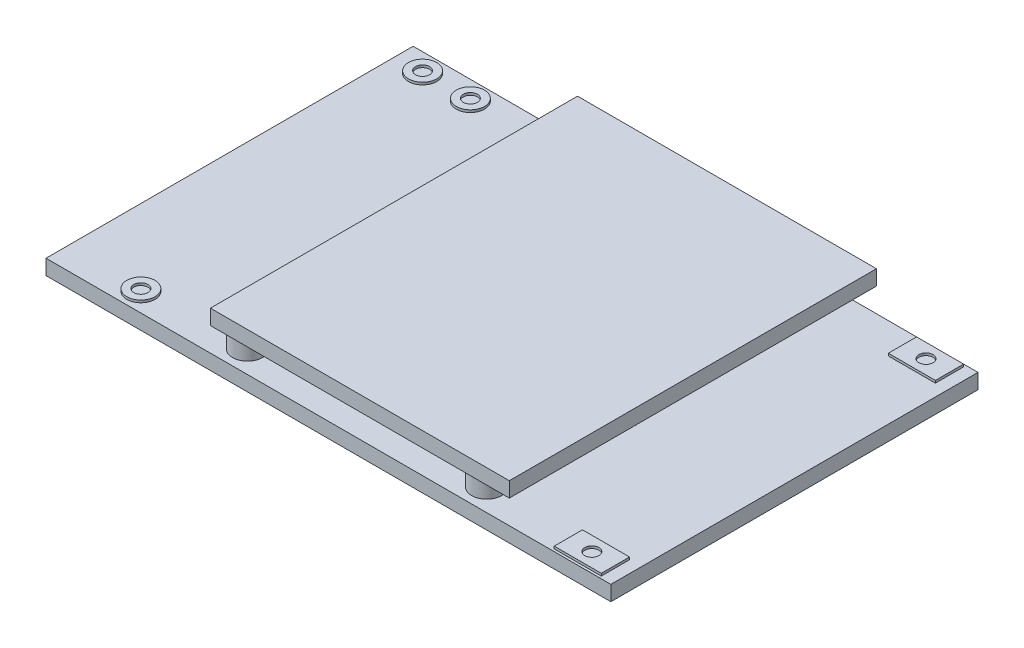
ISO-10303-21;
HEADER;
FILE_DESCRIPTION(('STEP AP214'),'2;1');
FILE_NAME('part.step','',(''),(''),'','','');
FILE_SCHEMA(('AUTOMOTIVE_DESIGN { 1 0 10303 214 1 1 1 1 }'));
ENDSEC;
DATA;
#1=APPLICATION_CONTEXT('core data for automotive mechanical design processes');
#2=APPLICATION_PROTOCOL_DEFINITION('international standard','automotive_design',2000,#1);
#3=PRODUCT_CONTEXT('',#1,'mechanical');
#4=PRODUCT('Part','Part','',(#3));
#5=PRODUCT_RELATED_PRODUCT_CATEGORY('part','',(#4));
#6=PRODUCT_DEFINITION_FORMATION('','',#4);
#7=PRODUCT_DEFINITION_CONTEXT('part definition',#1,'design');
#8=PRODUCT_DEFINITION('design','',#6,#7);
#9=PRODUCT_DEFINITION_SHAPE('','',#8);
#10=(LENGTH_UNIT() NAMED_UNIT(*) SI_UNIT(.MILLI.,.METRE.));
#11=(NAMED_UNIT(*) PLANE_ANGLE_UNIT() SI_UNIT($,.RADIAN.));
#12=(NAMED_UNIT(*) SI_UNIT($,.STERADIAN.) SOLID_ANGLE_UNIT());
#13=UNCERTAINTY_MEASURE_WITH_UNIT(LENGTH_MEASURE(1.E-05),#10,'distance_accuracy_value','');
#14=(GEOMETRIC_REPRESENTATION_CONTEXT(3) GLOBAL_UNCERTAINTY_ASSIGNED_CONTEXT((#13)) GLOBAL_UNIT_ASSIGNED_CONTEXT((#10,
#11,#12)) REPRESENTATION_CONTEXT('',''));
#15=CARTESIAN_POINT('',(0.,0.,0.));
#16=DIRECTION('',(0.,0.,1.));
#17=DIRECTION('',(1.,0.,0.));
#18=AXIS2_PLACEMENT_3D('',#15,#16,#17);
#19=CARTESIAN_POINT('',(30.,1.60020000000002,19.4999999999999));
#20=DIRECTION('',(-0.999999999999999,0.,0.));
#21=DIRECTION('',(0.,0.,0.999999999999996));
#22=AXIS2_PLACEMENT_3D('',#19,#20,#21);
#23=PLANE('',#22);
#24=DIRECTION('',(0.,0.,-0.999999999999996));
#25=VECTOR('',#24,1.);
#26=CARTESIAN_POINT('',(30.,0.,19.4999999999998));
#27=LINE('',#26,#25);
#28=CARTESIAN_POINT('',(30.,0.,19.4999999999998));
#29=VERTEX_POINT('',#28);
#30=CARTESIAN_POINT('',(30.0000000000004,0.,-19.5));
#31=VERTEX_POINT('',#30);
#32=EDGE_CURVE('E289',#29,#31,#27,.T.);
#33=ORIENTED_EDGE('',*,*,#32,.T.);
#34=DIRECTION('',(0.,-0.999999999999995,0.));
#35=VECTOR('',#34,1.);
#36=CARTESIAN_POINT('',(30.0000000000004,1.60020000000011,-19.5000000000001));
#37=LINE('',#36,#35);
#38=CARTESIAN_POINT('',(30.0000000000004,1.60020000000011,-19.5000000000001));
#39=VERTEX_POINT('',#38);
#40=EDGE_CURVE('E316',#39,#31,#37,.T.);
#41=ORIENTED_EDGE('',*,*,#40,.F.);
#42=DIRECTION('',(0.,0.,-0.999999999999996));
#43=VECTOR('',#42,1.);
#44=CARTESIAN_POINT('',(30.,1.60020000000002,19.4999999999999));
#45=LINE('',#44,#43);
#46=CARTESIAN_POINT('',(30.,1.60020000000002,19.4999999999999));
#47=VERTEX_POINT('',#46);
#48=EDGE_CURVE('E290',#47,#39,#45,.T.);
#49=ORIENTED_EDGE('',*,*,#48,.F.);
#50=DIRECTION('',(0.,-0.999999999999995,0.));
#51=VECTOR('',#50,1.);
#52=CARTESIAN_POINT('',(30.,1.60020000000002,19.4999999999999));
#53=LINE('',#52,#51);
#54=EDGE_CURVE('E300',#47,#29,#53,.T.);
#55=ORIENTED_EDGE('',*,*,#54,.T.);
#56=EDGE_LOOP('',(#33,#41,#49,#55));
#57=FACE_BOUND('',#56,.T.);
#58=ADVANCED_FACE('F34',(#57),#23,.F.);
#59=CARTESIAN_POINT('',(-29.9999999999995,1.6002,-19.4999999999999));
#60=DIRECTION('',(0.,0.,0.999999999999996));
#61=DIRECTION('',(0.999999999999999,0.,0.));
#62=AXIS2_PLACEMENT_3D('',#59,#60,#61);
#63=PLANE('',#62);
#64=DIRECTION('',(-0.999999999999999,0.,0.));
#65=VECTOR('',#64,1.);
#66=CARTESIAN_POINT('',(-29.9999999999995,-1.11022302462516E-13,-19.4999999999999));
#67=LINE('',#66,#65);
#68=CARTESIAN_POINT('',(-29.9999999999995,-1.11022302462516E-13,-19.4999999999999));
#69=VERTEX_POINT('',#68);
#70=EDGE_CURVE('E303',#31,#69,#67,.T.);
#71=ORIENTED_EDGE('',*,*,#70,.T.);
#72=DIRECTION('',(0.,-0.999999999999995,0.));
#73=VECTOR('',#72,1.);
#74=CARTESIAN_POINT('',(-29.9999999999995,1.6002,-19.4999999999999));
#75=LINE('',#74,#73);
#76=CARTESIAN_POINT('',(-29.9999999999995,1.6002,-19.4999999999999));
#77=VERTEX_POINT('',#76);
#78=EDGE_CURVE('E313',#77,#69,#75,.T.);
#79=ORIENTED_EDGE('',*,*,#78,.F.);
#80=DIRECTION('',(-0.999999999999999,0.,0.));
#81=VECTOR('',#80,1.);
#82=CARTESIAN_POINT('',(-29.9999999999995,1.6002,-19.4999999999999));
#83=LINE('',#82,#81);
#84=EDGE_CURVE('E293',#39,#77,#83,.T.);
#85=ORIENTED_EDGE('',*,*,#84,.F.);
#86=ORIENTED_EDGE('',*,*,#40,.T.);
#87=EDGE_LOOP('',(#71,#79,#85,#86));
#88=FACE_BOUND('',#87,.T.);
#89=ADVANCED_FACE('F364',(#88),#63,.F.);
#90=CARTESIAN_POINT('',(-29.9999999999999,1.60019999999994,19.5));
#91=DIRECTION('',(0.999999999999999,0.,0.));
#92=DIRECTION('',(0.,0.,-0.999999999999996));
#93=AXIS2_PLACEMENT_3D('',#90,#91,#92);
#94=PLANE('',#93);
#95=DIRECTION('',(0.,0.,0.999999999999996));
#96=VECTOR('',#95,1.);
#97=CARTESIAN_POINT('',(-29.9999999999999,0.,19.5));
#98=LINE('',#97,#96);
#99=CARTESIAN_POINT('',(-29.9999999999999,0.,19.5));
#100=VERTEX_POINT('',#99);
#101=EDGE_CURVE('E305',#69,#100,#98,.T.);
#102=ORIENTED_EDGE('',*,*,#101,.T.);
#103=DIRECTION('',(0.,-0.999999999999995,0.));
#104=VECTOR('',#103,1.);
#105=CARTESIAN_POINT('',(-29.9999999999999,1.60019999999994,19.5));
#106=LINE('',#105,#104);
#107=CARTESIAN_POINT('',(-29.9999999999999,1.60019999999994,19.5));
#108=VERTEX_POINT('',#107);
#109=EDGE_CURVE('E310',#108,#100,#106,.T.);
#110=ORIENTED_EDGE('',*,*,#109,.F.);
#111=DIRECTION('',(0.,0.,0.999999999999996));
#112=VECTOR('',#111,1.);
#113=CARTESIAN_POINT('',(-29.9999999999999,1.60019999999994,19.5));
#114=LINE('',#113,#112);
#115=EDGE_CURVE('E296',#77,#108,#114,.T.);
#116=ORIENTED_EDGE('',*,*,#115,.F.);
#117=ORIENTED_EDGE('',*,*,#78,.T.);
#118=EDGE_LOOP('',(#102,#110,#116,#117));
#119=FACE_BOUND('',#118,.T.);
#120=ADVANCED_FACE('F369',(#119),#94,.F.);
#121=CARTESIAN_POINT('',(-29.9999999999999,1.60019999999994,19.5));
#122=DIRECTION('',(0.,0.,-0.999999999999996));
#123=DIRECTION('',(-0.999999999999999,0.,0.));
#124=AXIS2_PLACEMENT_3D('',#121,#122,#123);
#125=PLANE('',#124);
#126=DIRECTION('',(0.999999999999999,0.,0.));
#127=VECTOR('',#126,1.);
#128=CARTESIAN_POINT('',(-29.9999999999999,0.,19.5));
#129=LINE('',#128,#127);
#130=EDGE_CURVE('E294',#100,#29,#129,.T.);
#131=ORIENTED_EDGE('',*,*,#130,.T.);
#132=ORIENTED_EDGE('',*,*,#54,.F.);
#133=DIRECTION('',(0.999999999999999,0.,0.));
#134=VECTOR('',#133,1.);
#135=CARTESIAN_POINT('',(-29.9999999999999,1.60019999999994,19.5));
#136=LINE('',#135,#134);
#137=EDGE_CURVE('E298',#108,#47,#136,.T.);
#138=ORIENTED_EDGE('',*,*,#137,.F.);
#139=ORIENTED_EDGE('',*,*,#109,.T.);
#140=EDGE_LOOP('',(#131,#132,#138,#139));
#141=FACE_BOUND('',#140,.T.);
#142=ADVANCED_FACE('F342',(#141),#125,.F.);
#143=CARTESIAN_POINT('',(0.,1.60020000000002,0.));
#144=DIRECTION('',(0.,-0.999999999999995,0.));
#145=DIRECTION('',(0.,0.,-0.999999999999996));
#146=AXIS2_PLACEMENT_3D('',#143,#144,#145);
#147=PLANE('',#146);
#148=DIRECTION('',(0.999999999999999,0.,0.));
#149=VECTOR('',#148,1.);
#150=CARTESIAN_POINT('',(23.73,1.60019999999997,19.2459999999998));
#151=LINE('',#150,#149);
#152=CARTESIAN_POINT('',(23.73,1.60019999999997,19.2459999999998));
#153=VERTEX_POINT('',#152);
#154=CARTESIAN_POINT('',(28.73,1.60020000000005,19.2459999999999));
#155=VERTEX_POINT('',#154);
#156=EDGE_CURVE('E173',#153,#155,#151,.T.);
#157=ORIENTED_EDGE('',*,*,#156,.F.);
#158=DIRECTION('',(0.,0.,0.999999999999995));
#159=VECTOR('',#158,1.);
#160=CARTESIAN_POINT('',(23.73,1.60019999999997,19.2459999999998));
#161=LINE('',#160,#159);
#162=CARTESIAN_POINT('',(23.7300000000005,1.6002,16.2459999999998));
#163=VERTEX_POINT('',#162);
#164=EDGE_CURVE('E170',#163,#153,#161,.T.);
#165=ORIENTED_EDGE('',*,*,#164,.F.);
#166=DIRECTION('',(-0.999999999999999,0.,0.));
#167=VECTOR('',#166,1.);
#168=CARTESIAN_POINT('',(23.7300000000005,1.6002,16.2459999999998));
#169=LINE('',#168,#167);
#170=CARTESIAN_POINT('',(28.7300000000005,1.6002,16.2459999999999));
#171=VERTEX_POINT('',#170);
#172=EDGE_CURVE('E53',#171,#163,#169,.T.);
#173=ORIENTED_EDGE('',*,*,#172,.F.);
#174=DIRECTION('',(0.,0.,-0.999999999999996));
#175=VECTOR('',#174,1.);
#176=CARTESIAN_POINT('',(28.73,1.60020000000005,19.2459999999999));
#177=LINE('',#176,#175);
#178=EDGE_CURVE('E48',#155,#171,#177,.T.);
#179=ORIENTED_EDGE('',*,*,#178,.F.);
#180=EDGE_LOOP('',(#157,#165,#173,#179));
#181=FACE_BOUND('',#180,.T.);
#182=CARTESIAN_POINT('',(-21.9199999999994,1.6002,17.5));
#183=DIRECTION('',(0.,-0.999999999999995,0.));
#184=DIRECTION('',(0.,0.,-0.999999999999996));
#185=AXIS2_PLACEMENT_3D('',#182,#183,#184);
#186=CIRCLE('',#185,1.5);
#187=CARTESIAN_POINT('',(-21.9199999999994,1.6002,15.9999999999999));
#188=VERTEX_POINT('',#187);
#189=EDGE_CURVE('E11',#188,#188,#186,.F.);
#190=ORIENTED_EDGE('',*,*,#189,.F.);
#191=EDGE_LOOP('',(#190));
#192=FACE_BOUND('',#191,.T.);
#193=DIRECTION('',(0.,0.,0.999999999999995));
#194=VECTOR('',#193,1.);
#195=CARTESIAN_POINT('',(23.7300000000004,1.60019999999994,-19.246));
#196=LINE('',#195,#194);
#197=CARTESIAN_POINT('',(23.7300000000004,1.60019999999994,-19.246));
#198=VERTEX_POINT('',#197);
#199=CARTESIAN_POINT('',(23.7300000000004,1.60020000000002,-16.2460000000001));
#200=VERTEX_POINT('',#199);
#201=EDGE_CURVE('E192',#198,#200,#196,.T.);
#202=ORIENTED_EDGE('',*,*,#201,.F.);
#203=DIRECTION('',(-0.999999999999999,0.,0.));
#204=VECTOR('',#203,1.);
#205=CARTESIAN_POINT('',(23.7300000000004,1.60019999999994,-19.246));
#206=LINE('',#205,#204);
#207=CARTESIAN_POINT('',(28.7300000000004,1.60020000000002,-19.246));
#208=VERTEX_POINT('',#207);
#209=EDGE_CURVE('E199',#208,#198,#206,.T.);
#210=ORIENTED_EDGE('',*,*,#209,.F.);
#211=DIRECTION('',(0.,0.,-0.999999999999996));
#212=VECTOR('',#211,1.);
#213=CARTESIAN_POINT('',(28.7300000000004,1.60020000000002,-19.246));
#214=LINE('',#213,#212);
#215=CARTESIAN_POINT('',(28.7300000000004,1.60020000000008,-16.246));
#216=VERTEX_POINT('',#215);
#217=EDGE_CURVE('E211',#216,#208,#214,.T.);
#218=ORIENTED_EDGE('',*,*,#217,.F.);
#219=DIRECTION('',(0.999999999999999,0.,0.));
#220=VECTOR('',#219,1.);
#221=CARTESIAN_POINT('',(23.7300000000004,1.60020000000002,-16.2460000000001));
#222=LINE('',#221,#220);
#223=EDGE_CURVE('E208',#200,#216,#222,.T.);
#224=ORIENTED_EDGE('',*,*,#223,.F.);
#225=EDGE_LOOP('',(#202,#210,#218,#224));
#226=FACE_BOUND('',#225,.T.);
#227=CARTESIAN_POINT('',(-21.9199999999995,1.60019999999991,-17.4999999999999));
#228=DIRECTION('',(0.,-0.999999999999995,0.));
#229=DIRECTION('',(0.,0.,-0.999999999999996));
#230=AXIS2_PLACEMENT_3D('',#227,#228,#229);
#231=CIRCLE('',#230,1.5);
#232=CARTESIAN_POINT('',(-21.9199999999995,1.60019999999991,-18.9999999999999));
#233=VERTEX_POINT('',#232);
#234=EDGE_CURVE('E41',#233,#233,#231,.F.);
#235=ORIENTED_EDGE('',*,*,#234,.F.);
#236=EDGE_LOOP('',(#235));
#237=FACE_BOUND('',#236,.T.);
#238=CARTESIAN_POINT('',(-26.9999999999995,1.60019999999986,-17.4999999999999));
#239=DIRECTION('',(0.,-0.999999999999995,0.));
#240=DIRECTION('',(0.,0.,-0.999999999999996));
#241=AXIS2_PLACEMENT_3D('',#238,#239,#240);
#242=CIRCLE('',#241,1.5);
#243=CARTESIAN_POINT('',(-26.9999999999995,1.60019999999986,-18.9999999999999));
#244=VERTEX_POINT('',#243);
#245=EDGE_CURVE('E331',#244,#244,#242,.F.);
#246=ORIENTED_EDGE('',*,*,#245,.F.);
#247=EDGE_LOOP('',(#246));
#248=FACE_BOUND('',#247,.T.);
#249=CARTESIAN_POINT('',(14.4500000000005,1.60019999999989,17.145));
#250=DIRECTION('',(0.,-0.999999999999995,0.));
#251=DIRECTION('',(0.,0.,-0.999999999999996));
#252=AXIS2_PLACEMENT_3D('',#249,#250,#251);
#253=CIRCLE('',#252,1.5875);
#254=CARTESIAN_POINT('',(14.4500000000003,1.60019999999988,15.5575));
#255=VERTEX_POINT('',#254);
#256=EDGE_CURVE('E328',#255,#255,#253,.F.);
#257=ORIENTED_EDGE('',*,*,#256,.F.);
#258=EDGE_LOOP('',(#257));
#259=FACE_BOUND('',#258,.T.);
#260=CARTESIAN_POINT('',(14.4500000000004,1.60019999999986,-17.145));
#261=DIRECTION('',(0.,-0.999999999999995,0.));
#262=DIRECTION('',(0.,0.,-0.999999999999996));
#263=AXIS2_PLACEMENT_3D('',#260,#261,#262);
#264=CIRCLE('',#263,1.5875);
#265=CARTESIAN_POINT('',(14.4500000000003,1.60019999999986,-18.7325));
#266=VERTEX_POINT('',#265);
#267=EDGE_CURVE('E325',#266,#266,#264,.F.);
#268=ORIENTED_EDGE('',*,*,#267,.F.);
#269=EDGE_LOOP('',(#268));
#270=FACE_BOUND('',#269,.T.);
#271=CARTESIAN_POINT('',(-10.9499999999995,1.60019999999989,-17.145));
#272=DIRECTION('',(0.,-0.999999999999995,0.));
#273=DIRECTION('',(0.,0.,-0.999999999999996));
#274=AXIS2_PLACEMENT_3D('',#271,#272,#273);
#275=CIRCLE('',#274,1.5875);
#276=CARTESIAN_POINT('',(-10.9499999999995,1.60019999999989,-18.7325));
#277=VERTEX_POINT('',#276);
#278=EDGE_CURVE('E322',#277,#277,#275,.F.);
#279=ORIENTED_EDGE('',*,*,#278,.F.);
#280=EDGE_LOOP('',(#279));
#281=FACE_BOUND('',#280,.T.);
#282=CARTESIAN_POINT('',(-10.9499999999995,1.60019999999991,17.1449999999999));
#283=DIRECTION('',(0.,-0.999999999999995,0.));
#284=DIRECTION('',(0.,0.,-0.999999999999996));
#285=AXIS2_PLACEMENT_3D('',#282,#283,#284);
#286=CIRCLE('',#285,1.5875);
#287=CARTESIAN_POINT('',(-10.9499999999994,1.60019999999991,15.5574999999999));
#288=VERTEX_POINT('',#287);
#289=EDGE_CURVE('E319',#288,#288,#286,.F.);
#290=ORIENTED_EDGE('',*,*,#289,.F.);
#291=EDGE_LOOP('',(#290));
#292=FACE_BOUND('',#291,.T.);
#293=ORIENTED_EDGE('',*,*,#48,.T.);
#294=ORIENTED_EDGE('',*,*,#84,.T.);
#295=ORIENTED_EDGE('',*,*,#115,.T.);
#296=ORIENTED_EDGE('',*,*,#137,.T.);
#297=EDGE_LOOP('',(#293,#294,#295,#296));
#298=FACE_BOUND('',#297,.T.);
#299=ADVANCED_FACE('F338',(#181,#192,#226,#237,#248,#259,#270,#281,#292,#298),#147,.F.);
#300=CARTESIAN_POINT('',(0.,0.,0.));
#301=DIRECTION('',(0.,-0.999999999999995,0.));
#302=DIRECTION('',(0.,0.,-0.999999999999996));
#303=AXIS2_PLACEMENT_3D('',#300,#301,#302);
#304=PLANE('',#303);
#305=ORIENTED_EDGE('',*,*,#32,.F.);
#306=ORIENTED_EDGE('',*,*,#130,.F.);
#307=ORIENTED_EDGE('',*,*,#101,.F.);
#308=ORIENTED_EDGE('',*,*,#70,.F.);
#309=EDGE_LOOP('',(#305,#306,#307,#308));
#310=FACE_BOUND('',#309,.T.);
#311=ADVANCED_FACE('F341',(#310),#304,.T.);
#312=CARTESIAN_POINT('',(-10.9499999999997,4.14019999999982,17.1449999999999));
#313=DIRECTION('',(0.,-0.999999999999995,0.));
#314=DIRECTION('',(0.,0.,-0.999999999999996));
#315=AXIS2_PLACEMENT_3D('',#312,#313,#314);
#316=CYLINDRICAL_SURFACE('',#315,1.5875);
#317=CARTESIAN_POINT('',(-10.9499999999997,4.14019999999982,17.1449999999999));
#318=DIRECTION('',(0.,0.999999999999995,0.));
#319=DIRECTION('',(0.,0.,0.999999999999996));
#320=AXIS2_PLACEMENT_3D('',#317,#318,#319);
#321=CIRCLE('',#320,1.5875);
#322=CARTESIAN_POINT('',(-12.5374999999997,4.14019999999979,17.1449999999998));
#323=VERTEX_POINT('',#322);
#324=EDGE_CURVE('E286',#323,#323,#321,.T.);
#325=ORIENTED_EDGE('',*,*,#324,.F.);
#326=EDGE_LOOP('',(#325));
#327=FACE_BOUND('',#326,.T.);
#328=ORIENTED_EDGE('',*,*,#289,.T.);
#329=EDGE_LOOP('',(#328));
#330=FACE_BOUND('',#329,.T.);
#331=ADVANCED_FACE('F374',(#327,#330),#316,.T.);
#332=CARTESIAN_POINT('',(-10.9499999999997,4.1401999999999,-17.1449999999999));
#333=DIRECTION('',(0.,-0.999999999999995,0.));
#334=DIRECTION('',(0.,0.,-0.999999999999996));
#335=AXIS2_PLACEMENT_3D('',#332,#333,#334);
#336=CYLINDRICAL_SURFACE('',#335,1.5875);
#337=CARTESIAN_POINT('',(-10.9499999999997,4.1401999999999,-17.1449999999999));
#338=DIRECTION('',(0.,0.999999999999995,0.));
#339=DIRECTION('',(0.,0.,0.999999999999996));
#340=AXIS2_PLACEMENT_3D('',#337,#338,#339);
#341=CIRCLE('',#340,1.5875);
#342=CARTESIAN_POINT('',(-12.5374999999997,4.14019999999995,-17.1449999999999));
#343=VERTEX_POINT('',#342);
#344=EDGE_CURVE('E283',#343,#343,#341,.T.);
#345=ORIENTED_EDGE('',*,*,#344,.F.);
#346=EDGE_LOOP('',(#345));
#347=FACE_BOUND('',#346,.T.);
#348=ORIENTED_EDGE('',*,*,#278,.T.);
#349=EDGE_LOOP('',(#348));
#350=FACE_BOUND('',#349,.T.);
#351=ADVANCED_FACE('F379',(#347,#350),#336,.T.);
#352=CARTESIAN_POINT('',(14.4500000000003,4.14019999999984,-17.145));
#353=DIRECTION('',(0.,-0.999999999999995,0.));
#354=DIRECTION('',(0.,0.,-0.999999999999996));
#355=AXIS2_PLACEMENT_3D('',#352,#353,#354);
#356=CYLINDRICAL_SURFACE('',#355,1.5875);
#357=CARTESIAN_POINT('',(14.4500000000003,4.14019999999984,-17.145));
#358=DIRECTION('',(0.,0.999999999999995,0.));
#359=DIRECTION('',(0.,0.,0.999999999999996));
#360=AXIS2_PLACEMENT_3D('',#357,#358,#359);
#361=CIRCLE('',#360,1.5875);
#362=CARTESIAN_POINT('',(14.4500000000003,4.14019999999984,-18.7325));
#363=VERTEX_POINT('',#362);
#364=EDGE_CURVE('E280',#363,#363,#361,.T.);
#365=CARTESIAN_POINT('',(14.4500000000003,4.14019999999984,-18.7325));
#366=CARTESIAN_POINT('',(14.4500000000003,4.11374166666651,-18.7325));
#367=CARTESIAN_POINT('',(14.4500000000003,4.08728333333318,-18.7325));
#368=CARTESIAN_POINT('',(14.4500000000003,4.03436666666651,-18.7325));
#369=CARTESIAN_POINT('',(14.4500000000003,4.00790833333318,-18.7325));
#370=CARTESIAN_POINT('',(14.4500000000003,3.95499166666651,-18.7325));
#371=CARTESIAN_POINT('',(14.4500000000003,3.92853333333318,-18.7325));
#372=CARTESIAN_POINT('',(14.4500000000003,3.87561666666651,-18.7325));
#373=CARTESIAN_POINT('',(14.4500000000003,3.84915833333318,-18.7325));
#374=CARTESIAN_POINT('',(14.4500000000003,3.79624166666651,-18.7325));
#375=CARTESIAN_POINT('',(14.4500000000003,3.76978333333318,-18.7325));
#376=CARTESIAN_POINT('',(14.4500000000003,3.71686666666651,-18.7325));
#377=CARTESIAN_POINT('',(14.4500000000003,3.69040833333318,-18.7325));
#378=CARTESIAN_POINT('',(14.4500000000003,3.63749166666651,-18.7325));
#379=CARTESIAN_POINT('',(14.4500000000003,3.61103333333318,-18.7325));
#380=CARTESIAN_POINT('',(14.4500000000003,3.55811666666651,-18.7325));
#381=CARTESIAN_POINT('',(14.4500000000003,3.53165833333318,-18.7325));
#382=CARTESIAN_POINT('',(14.4500000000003,3.47874166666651,-18.7325));
#383=CARTESIAN_POINT('',(14.4500000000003,3.45228333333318,-18.7325));
#384=CARTESIAN_POINT('',(14.4500000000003,3.39936666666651,-18.7325));
#385=CARTESIAN_POINT('',(14.4500000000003,3.37290833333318,-18.7325));
#386=CARTESIAN_POINT('',(14.4500000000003,3.31999166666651,-18.7325));
#387=CARTESIAN_POINT('',(14.4500000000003,3.29353333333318,-18.7325));
#388=CARTESIAN_POINT('',(14.4500000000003,3.24061666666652,-18.7325));
#389=CARTESIAN_POINT('',(14.4500000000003,3.21415833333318,-18.7325));
#390=CARTESIAN_POINT('',(14.4500000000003,3.16124166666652,-18.7325));
#391=CARTESIAN_POINT('',(14.4500000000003,3.13478333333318,-18.7325));
#392=CARTESIAN_POINT('',(14.4500000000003,3.08186666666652,-18.7325));
#393=CARTESIAN_POINT('',(14.4500000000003,3.05540833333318,-18.7325));
#394=CARTESIAN_POINT('',(14.4500000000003,3.00249166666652,-18.7325));
#395=CARTESIAN_POINT('',(14.4500000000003,2.97603333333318,-18.7325));
#396=CARTESIAN_POINT('',(14.4500000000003,2.92311666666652,-18.7325));
#397=CARTESIAN_POINT('',(14.4500000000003,2.89665833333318,-18.7325));
#398=CARTESIAN_POINT('',(14.4500000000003,2.84374166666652,-18.7325));
#399=CARTESIAN_POINT('',(14.4500000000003,2.81728333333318,-18.7325));
#400=CARTESIAN_POINT('',(14.4500000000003,2.76436666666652,-18.7325));
#401=CARTESIAN_POINT('',(14.4500000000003,2.73790833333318,-18.7325));
#402=CARTESIAN_POINT('',(14.4500000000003,2.68499166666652,-18.7325));
#403=CARTESIAN_POINT('',(14.4500000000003,2.65853333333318,-18.7325));
#404=CARTESIAN_POINT('',(14.4500000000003,2.60561666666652,-18.7325));
#405=CARTESIAN_POINT('',(14.4500000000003,2.57915833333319,-18.7325));
#406=CARTESIAN_POINT('',(14.4500000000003,2.52624166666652,-18.7325));
#407=CARTESIAN_POINT('',(14.4500000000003,2.49978333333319,-18.7325));
#408=CARTESIAN_POINT('',(14.4500000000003,2.44686666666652,-18.7325));
#409=CARTESIAN_POINT('',(14.4500000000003,2.42040833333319,-18.7325));
#410=CARTESIAN_POINT('',(14.4500000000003,2.36749166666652,-18.7325));
#411=CARTESIAN_POINT('',(14.4500000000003,2.34103333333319,-18.7325));
#412=CARTESIAN_POINT('',(14.4500000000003,2.28811666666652,-18.7325));
#413=CARTESIAN_POINT('',(14.4500000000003,2.26165833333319,-18.7325));
#414=CARTESIAN_POINT('',(14.4500000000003,2.20874166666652,-18.7325));
#415=CARTESIAN_POINT('',(14.4500000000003,2.18228333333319,-18.7325));
#416=CARTESIAN_POINT('',(14.4500000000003,2.12936666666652,-18.7325));
#417=CARTESIAN_POINT('',(14.4500000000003,2.10290833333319,-18.7325));
#418=CARTESIAN_POINT('',(14.4500000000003,2.04999166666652,-18.7325));
#419=CARTESIAN_POINT('',(14.4500000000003,2.02353333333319,-18.7325));
#420=CARTESIAN_POINT('',(14.4500000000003,1.97061666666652,-18.7325));
#421=CARTESIAN_POINT('',(14.4500000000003,1.94415833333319,-18.7325));
#422=CARTESIAN_POINT('',(14.4500000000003,1.89124166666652,-18.7325));
#423=CARTESIAN_POINT('',(14.4500000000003,1.86478333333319,-18.7325));
#424=CARTESIAN_POINT('',(14.4500000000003,1.81186666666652,-18.7325));
#425=CARTESIAN_POINT('',(14.4500000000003,1.78540833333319,-18.7325));
#426=CARTESIAN_POINT('',(14.4500000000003,1.73249166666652,-18.7325));
#427=CARTESIAN_POINT('',(14.4500000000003,1.70603333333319,-18.7325));
#428=CARTESIAN_POINT('',(14.4500000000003,1.65311666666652,-18.7325));
#429=CARTESIAN_POINT('',(14.4500000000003,1.62665833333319,-18.7325));
#430=CARTESIAN_POINT('',(14.4500000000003,1.60019999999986,-18.7325));
#431=B_SPLINE_CURVE_WITH_KNOTS('',3,(#365,#366,#367,#368,#369,#370,#371,#372,#373,#374,#375,
#376,#377,#378,#379,#380,#381,#382,#383,#384,#385,#386,#387,#388,#389,#390,#391,#392,#393,#394,
#395,#396,#397,#398,#399,#400,#401,#402,#403,#404,#405,#406,#407,#408,#409,#410,#411,#412,#413,
#414,#415,#416,#417,#418,#419,#420,#421,#422,#423,#424,#425,#426,#427,#428,#429,#430),
.UNSPECIFIED.,.F.,.F.,(4,2,2,2,2,2,2,2,2,2,2,2,2,2,2,2,2,2,2,2,2,2,2,2,2,2,2,2,2,2,2,2,4),(0.,
0.0793749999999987,0.158749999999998,0.238124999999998,0.317499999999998,0.396874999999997,
0.476249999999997,0.555624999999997,0.634999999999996,0.714374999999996,0.793749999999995,
0.873124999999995,0.952499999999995,1.03187499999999,1.11124999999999,1.19062499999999,
1.26999999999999,1.34937499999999,1.42874999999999,1.50812499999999,1.58749999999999,
1.66687499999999,1.74624999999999,1.82562499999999,1.90499999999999,1.98437499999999,
2.06374999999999,2.14312499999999,2.22249999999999,2.30187499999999,2.38124999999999,
2.46062499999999,2.53999999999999),.UNSPECIFIED.);
#432=EDGE_CURVE('BSEAM419',#363,#266,#431,.T.);
#433=ORIENTED_EDGE('',*,*,#364,.F.);
#434=ORIENTED_EDGE('',*,*,#267,.T.);
#435=ORIENTED_EDGE('',*,*,#432,.T.);
#436=ORIENTED_EDGE('',*,*,#432,.F.);
#437=EDGE_LOOP('',(#433,#435,#434,#436));
#438=FACE_BOUND('',#437,.T.);
#439=ADVANCED_FACE('F419',(#438),#356,.T.);
#440=CARTESIAN_POINT('',(14.4500000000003,4.1401999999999,17.145));
#441=DIRECTION('',(0.,-0.999999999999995,0.));
#442=DIRECTION('',(0.,0.,-0.999999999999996));
#443=AXIS2_PLACEMENT_3D('',#440,#441,#442);
#444=CYLINDRICAL_SURFACE('',#443,1.5875);
#445=CARTESIAN_POINT('',(14.4500000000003,4.1401999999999,17.145));
#446=DIRECTION('',(0.,0.999999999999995,0.));
#447=DIRECTION('',(0.,0.,0.999999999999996));
#448=AXIS2_PLACEMENT_3D('',#445,#446,#447);
#449=CIRCLE('',#448,1.5875);
#450=CARTESIAN_POINT('',(14.4500000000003,4.1401999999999,15.5575));
#451=VERTEX_POINT('',#450);
#452=EDGE_CURVE('E277',#451,#451,#449,.T.);
#453=CARTESIAN_POINT('',(14.4500000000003,4.1401999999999,15.5575));
#454=CARTESIAN_POINT('',(14.4500000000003,4.11374166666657,15.5575));
#455=CARTESIAN_POINT('',(14.4500000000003,4.08728333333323,15.5575));
#456=CARTESIAN_POINT('',(14.4500000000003,4.03436666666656,15.5575));
#457=CARTESIAN_POINT('',(14.4500000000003,4.00790833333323,15.5575));
#458=CARTESIAN_POINT('',(14.4500000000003,3.95499166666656,15.5575));
#459=CARTESIAN_POINT('',(14.4500000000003,3.92853333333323,15.5575));
#460=CARTESIAN_POINT('',(14.4500000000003,3.87561666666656,15.5575));
#461=CARTESIAN_POINT('',(14.4500000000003,3.84915833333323,15.5575));
#462=CARTESIAN_POINT('',(14.4500000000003,3.79624166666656,15.5575));
#463=CARTESIAN_POINT('',(14.4500000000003,3.76978333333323,15.5575));
#464=CARTESIAN_POINT('',(14.4500000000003,3.71686666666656,15.5575));
#465=CARTESIAN_POINT('',(14.4500000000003,3.69040833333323,15.5575));
#466=CARTESIAN_POINT('',(14.4500000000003,3.63749166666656,15.5575));
#467=CARTESIAN_POINT('',(14.4500000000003,3.61103333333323,15.5575));
#468=CARTESIAN_POINT('',(14.4500000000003,3.55811666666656,15.5575));
#469=CARTESIAN_POINT('',(14.4500000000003,3.53165833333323,15.5575));
#470=CARTESIAN_POINT('',(14.4500000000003,3.47874166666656,15.5575));
#471=CARTESIAN_POINT('',(14.4500000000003,3.45228333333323,15.5575));
#472=CARTESIAN_POINT('',(14.4500000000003,3.39936666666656,15.5575));
#473=CARTESIAN_POINT('',(14.4500000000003,3.37290833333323,15.5575));
#474=CARTESIAN_POINT('',(14.4500000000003,3.31999166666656,15.5575));
#475=CARTESIAN_POINT('',(14.4500000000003,3.29353333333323,15.5575));
#476=CARTESIAN_POINT('',(14.4500000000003,3.24061666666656,15.5575));
#477=CARTESIAN_POINT('',(14.4500000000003,3.21415833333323,15.5575));
#478=CARTESIAN_POINT('',(14.4500000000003,3.16124166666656,15.5575));
#479=CARTESIAN_POINT('',(14.4500000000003,3.13478333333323,15.5575));
#480=CARTESIAN_POINT('',(14.4500000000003,3.08186666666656,15.5575));
#481=CARTESIAN_POINT('',(14.4500000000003,3.05540833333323,15.5575));
#482=CARTESIAN_POINT('',(14.4500000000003,3.00249166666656,15.5575));
#483=CARTESIAN_POINT('',(14.4500000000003,2.97603333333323,15.5575));
#484=CARTESIAN_POINT('',(14.4500000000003,2.92311666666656,15.5575));
#485=CARTESIAN_POINT('',(14.4500000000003,2.89665833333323,15.5575));
#486=CARTESIAN_POINT('',(14.4500000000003,2.84374166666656,15.5575));
#487=CARTESIAN_POINT('',(14.4500000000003,2.81728333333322,15.5575));
#488=CARTESIAN_POINT('',(14.4500000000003,2.76436666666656,15.5575));
#489=CARTESIAN_POINT('',(14.4500000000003,2.73790833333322,15.5575));
#490=CARTESIAN_POINT('',(14.4500000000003,2.68499166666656,15.5575));
#491=CARTESIAN_POINT('',(14.4500000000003,2.65853333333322,15.5575));
#492=CARTESIAN_POINT('',(14.4500000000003,2.60561666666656,15.5575));
#493=CARTESIAN_POINT('',(14.4500000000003,2.57915833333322,15.5575));
#494=CARTESIAN_POINT('',(14.4500000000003,2.52624166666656,15.5575));
#495=CARTESIAN_POINT('',(14.4500000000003,2.49978333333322,15.5575));
#496=CARTESIAN_POINT('',(14.4500000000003,2.44686666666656,15.5575));
#497=CARTESIAN_POINT('',(14.4500000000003,2.42040833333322,15.5575));
#498=CARTESIAN_POINT('',(14.4500000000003,2.36749166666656,15.5575));
#499=CARTESIAN_POINT('',(14.4500000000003,2.34103333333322,15.5575));
#500=CARTESIAN_POINT('',(14.4500000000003,2.28811666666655,15.5575));
#501=CARTESIAN_POINT('',(14.4500000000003,2.26165833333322,15.5575));
#502=CARTESIAN_POINT('',(14.4500000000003,2.20874166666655,15.5575));
#503=CARTESIAN_POINT('',(14.4500000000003,2.18228333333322,15.5575));
#504=CARTESIAN_POINT('',(14.4500000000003,2.12936666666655,15.5575));
#505=CARTESIAN_POINT('',(14.4500000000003,2.10290833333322,15.5575));
#506=CARTESIAN_POINT('',(14.4500000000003,2.04999166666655,15.5575));
#507=CARTESIAN_POINT('',(14.4500000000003,2.02353333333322,15.5575));
#508=CARTESIAN_POINT('',(14.4500000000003,1.97061666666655,15.5575));
#509=CARTESIAN_POINT('',(14.4500000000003,1.94415833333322,15.5575));
#510=CARTESIAN_POINT('',(14.4500000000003,1.89124166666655,15.5575));
#511=CARTESIAN_POINT('',(14.4500000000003,1.86478333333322,15.5575));
#512=CARTESIAN_POINT('',(14.4500000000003,1.81186666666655,15.5575));
#513=CARTESIAN_POINT('',(14.4500000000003,1.78540833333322,15.5575));
#514=CARTESIAN_POINT('',(14.4500000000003,1.73249166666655,15.5575));
#515=CARTESIAN_POINT('',(14.4500000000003,1.70603333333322,15.5575));
#516=CARTESIAN_POINT('',(14.4500000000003,1.65311666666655,15.5575));
#517=CARTESIAN_POINT('',(14.4500000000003,1.62665833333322,15.5575));
#518=CARTESIAN_POINT('',(14.4500000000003,1.60019999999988,15.5575));
#519=B_SPLINE_CURVE_WITH_KNOTS('',3,(#453,#454,#455,#456,#457,#458,#459,#460,#461,#462,#463,
#464,#465,#466,#467,#468,#469,#470,#471,#472,#473,#474,#475,#476,#477,#478,#479,#480,#481,#482,
#483,#484,#485,#486,#487,#488,#489,#490,#491,#492,#493,#494,#495,#496,#497,#498,#499,#500,#501,
#502,#503,#504,#505,#506,#507,#508,#509,#510,#511,#512,#513,#514,#515,#516,#517,#518),
.UNSPECIFIED.,.F.,.F.,(4,2,2,2,2,2,2,2,2,2,2,2,2,2,2,2,2,2,2,2,2,2,2,2,2,2,2,2,2,2,2,2,4),(0.,
0.0793750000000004,0.15875,0.238125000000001,0.317500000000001,0.396875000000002,
0.476250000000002,0.555625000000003,0.635000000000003,0.714375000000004,0.793750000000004,
0.873125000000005,0.952500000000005,1.03187500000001,1.11125000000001,1.19062500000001,
1.27000000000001,1.34937500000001,1.42875000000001,1.50812500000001,1.58750000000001,
1.66687500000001,1.74625000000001,1.82562500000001,1.90500000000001,1.98437500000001,
2.06375000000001,2.14312500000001,2.22250000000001,2.30187500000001,2.38125000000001,
2.46062500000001,2.54000000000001),.UNSPECIFIED.);
#520=EDGE_CURVE('BSEAM429',#451,#255,#519,.T.);
#521=ORIENTED_EDGE('',*,*,#452,.F.);
#522=ORIENTED_EDGE('',*,*,#256,.T.);
#523=ORIENTED_EDGE('',*,*,#520,.T.);
#524=ORIENTED_EDGE('',*,*,#520,.F.);
#525=EDGE_LOOP('',(#521,#523,#522,#524));
#526=FACE_BOUND('',#525,.T.);
#527=ADVANCED_FACE('F429',(#526),#444,.T.);
#528=CARTESIAN_POINT('',(-12.5374999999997,5.7403999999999,-19.4999999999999));
#529=DIRECTION('',(0.999999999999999,0.,0.));
#530=DIRECTION('',(0.,0.,-0.999999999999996));
#531=AXIS2_PLACEMENT_3D('',#528,#529,#530);
#532=PLANE('',#531);
#533=DIRECTION('',(0.,0.,0.999999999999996));
#534=VECTOR('',#533,1.);
#535=CARTESIAN_POINT('',(-12.5374999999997,4.14020000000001,-19.4999999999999));
#536=LINE('',#535,#534);
#537=CARTESIAN_POINT('',(-12.5374999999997,4.14020000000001,-19.4999999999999));
#538=VERTEX_POINT('',#537);
#539=EDGE_CURVE('E257',#538,#343,#536,.T.);
#540=ORIENTED_EDGE('',*,*,#539,.T.);
#541=EDGE_CURVE('E261',#343,#323,#536,.T.);
#542=ORIENTED_EDGE('',*,*,#541,.T.);
#543=CARTESIAN_POINT('',(-12.5374999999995,4.1401999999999,19.5));
#544=VERTEX_POINT('',#543);
#545=EDGE_CURVE('E245',#323,#544,#536,.T.);
#546=ORIENTED_EDGE('',*,*,#545,.T.);
#547=DIRECTION('',(0.,-0.999999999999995,0.));
#548=VECTOR('',#547,1.);
#549=CARTESIAN_POINT('',(-12.5374999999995,5.74039999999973,19.4999999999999));
#550=LINE('',#549,#548);
#551=CARTESIAN_POINT('',(-12.5374999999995,5.74039999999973,19.4999999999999));
#552=VERTEX_POINT('',#551);
#553=EDGE_CURVE('E274',#552,#544,#550,.T.);
#554=ORIENTED_EDGE('',*,*,#553,.F.);
#555=DIRECTION('',(0.,0.,0.999999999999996));
#556=VECTOR('',#555,1.);
#557=CARTESIAN_POINT('',(-12.5374999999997,5.7403999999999,-19.4999999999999));
#558=LINE('',#557,#556);
#559=CARTESIAN_POINT('',(-12.5374999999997,5.7403999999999,-19.4999999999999));
#560=VERTEX_POINT('',#559);
#561=EDGE_CURVE('E246',#560,#552,#558,.T.);
#562=ORIENTED_EDGE('',*,*,#561,.F.);
#563=DIRECTION('',(0.,-0.999999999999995,0.));
#564=VECTOR('',#563,1.);
#565=CARTESIAN_POINT('',(-12.5374999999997,5.7403999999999,-19.4999999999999));
#566=LINE('',#565,#564);
#567=EDGE_CURVE('E256',#560,#538,#566,.T.);
#568=ORIENTED_EDGE('',*,*,#567,.T.);
#569=EDGE_LOOP('',(#540,#542,#546,#554,#562,#568));
#570=FACE_BOUND('',#569,.T.);
#571=ADVANCED_FACE('F439',(#570),#532,.F.);
#572=CARTESIAN_POINT('',(-12.5374999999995,5.74039999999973,19.4999999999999));
#573=DIRECTION('',(0.,0.,-0.999999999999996));
#574=DIRECTION('',(-0.999999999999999,0.,0.));
#575=AXIS2_PLACEMENT_3D('',#572,#573,#574);
#576=PLANE('',#575);
#577=DIRECTION('',(0.999999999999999,0.,0.));
#578=VECTOR('',#577,1.);
#579=CARTESIAN_POINT('',(-12.5374999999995,4.1401999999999,19.5));
#580=LINE('',#579,#578);
#581=CARTESIAN_POINT('',(19.2125000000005,4.14020000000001,19.4999999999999));
#582=VERTEX_POINT('',#581);
#583=EDGE_CURVE('E260',#544,#582,#580,.T.);
#584=ORIENTED_EDGE('',*,*,#583,.T.);
#585=DIRECTION('',(0.,-0.999999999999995,0.));
#586=VECTOR('',#585,1.);
#587=CARTESIAN_POINT('',(19.2125000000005,5.74040000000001,19.4999999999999));
#588=LINE('',#587,#586);
#589=CARTESIAN_POINT('',(19.2125000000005,5.74040000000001,19.4999999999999));
#590=VERTEX_POINT('',#589);
#591=EDGE_CURVE('E271',#590,#582,#588,.T.);
#592=ORIENTED_EDGE('',*,*,#591,.F.);
#593=DIRECTION('',(0.999999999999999,0.,0.));
#594=VECTOR('',#593,1.);
#595=CARTESIAN_POINT('',(-12.5374999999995,5.74039999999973,19.4999999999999));
#596=LINE('',#595,#594);
#597=EDGE_CURVE('E249',#552,#590,#596,.T.);
#598=ORIENTED_EDGE('',*,*,#597,.F.);
#599=ORIENTED_EDGE('',*,*,#553,.T.);
#600=EDGE_LOOP('',(#584,#592,#598,#599));
#601=FACE_BOUND('',#600,.T.);
#602=ADVANCED_FACE('F449',(#601),#576,.F.);
#603=CARTESIAN_POINT('',(19.2125000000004,5.74039999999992,-19.5));
#604=DIRECTION('',(-0.999999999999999,0.,0.));
#605=DIRECTION('',(0.,0.,0.999999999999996));
#606=AXIS2_PLACEMENT_3D('',#603,#604,#605);
#607=PLANE('',#606);
#608=DIRECTION('',(0.,0.,-0.999999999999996));
#609=VECTOR('',#608,1.);
#610=CARTESIAN_POINT('',(19.2125000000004,4.14019999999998,-19.5));
#611=LINE('',#610,#609);
#612=CARTESIAN_POINT('',(19.2125000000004,4.14019999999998,-19.5));
#613=VERTEX_POINT('',#612);
#614=EDGE_CURVE('E263',#582,#613,#611,.T.);
#615=ORIENTED_EDGE('',*,*,#614,.T.);
#616=DIRECTION('',(0.,-0.999999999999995,0.));
#617=VECTOR('',#616,1.);
#618=CARTESIAN_POINT('',(19.2125000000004,5.74039999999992,-19.5));
#619=LINE('',#618,#617);
#620=CARTESIAN_POINT('',(19.2125000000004,5.74039999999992,-19.5));
#621=VERTEX_POINT('',#620);
#622=EDGE_CURVE('E268',#621,#613,#619,.T.);
#623=ORIENTED_EDGE('',*,*,#622,.F.);
#624=DIRECTION('',(0.,0.,-0.999999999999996));
#625=VECTOR('',#624,1.);
#626=CARTESIAN_POINT('',(19.2125000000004,5.74039999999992,-19.5));
#627=LINE('',#626,#625);
#628=EDGE_CURVE('E252',#590,#621,#627,.T.);
#629=ORIENTED_EDGE('',*,*,#628,.F.);
#630=ORIENTED_EDGE('',*,*,#591,.T.);
#631=EDGE_LOOP('',(#615,#623,#629,#630));
#632=FACE_BOUND('',#631,.T.);
#633=ADVANCED_FACE('F459',(#632),#607,.F.);
#634=CARTESIAN_POINT('',(-12.5374999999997,5.7403999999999,-19.4999999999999));
#635=DIRECTION('',(0.,0.,0.999999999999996));
#636=DIRECTION('',(0.999999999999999,0.,0.));
#637=AXIS2_PLACEMENT_3D('',#634,#635,#636);
#638=PLANE('',#637);
#639=DIRECTION('',(-0.999999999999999,0.,0.));
#640=VECTOR('',#639,1.);
#641=CARTESIAN_POINT('',(-12.5374999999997,4.14020000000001,-19.4999999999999));
#642=LINE('',#641,#640);
#643=EDGE_CURVE('E250',#613,#538,#642,.T.);
#644=ORIENTED_EDGE('',*,*,#643,.T.);
#645=ORIENTED_EDGE('',*,*,#567,.F.);
#646=DIRECTION('',(-0.999999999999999,0.,0.));
#647=VECTOR('',#646,1.);
#648=CARTESIAN_POINT('',(-12.5374999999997,5.7403999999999,-19.4999999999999));
#649=LINE('',#648,#647);
#650=EDGE_CURVE('E254',#621,#560,#649,.T.);
#651=ORIENTED_EDGE('',*,*,#650,.F.);
#652=ORIENTED_EDGE('',*,*,#622,.T.);
#653=EDGE_LOOP('',(#644,#645,#651,#652));
#654=FACE_BOUND('',#653,.T.);
#655=ADVANCED_FACE('F469',(#654),#638,.F.);
#656=CARTESIAN_POINT('',(0.,5.74040000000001,0.));
#657=DIRECTION('',(0.,0.999999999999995,0.));
#658=DIRECTION('',(0.,0.,0.999999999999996));
#659=AXIS2_PLACEMENT_3D('',#656,#657,#658);
#660=PLANE('',#659);
#661=ORIENTED_EDGE('',*,*,#561,.T.);
#662=ORIENTED_EDGE('',*,*,#597,.T.);
#663=ORIENTED_EDGE('',*,*,#628,.T.);
#664=ORIENTED_EDGE('',*,*,#650,.T.);
#665=EDGE_LOOP('',(#661,#662,#663,#664));
#666=FACE_BOUND('',#665,.T.);
#667=ADVANCED_FACE('F479',(#666),#660,.T.);
#668=CARTESIAN_POINT('',(0.,4.14019999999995,0.));
#669=DIRECTION('',(0.,0.999999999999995,0.));
#670=DIRECTION('',(0.,0.,0.999999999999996));
#671=AXIS2_PLACEMENT_3D('',#668,#669,#670);
#672=PLANE('',#671);
#673=ORIENTED_EDGE('',*,*,#364,.T.);
#674=EDGE_LOOP('',(#673));
#675=FACE_BOUND('',#674,.T.);
#676=ORIENTED_EDGE('',*,*,#452,.T.);
#677=EDGE_LOOP('',(#676));
#678=FACE_BOUND('',#677,.T.);
#679=ORIENTED_EDGE('',*,*,#545,.F.);
#680=ORIENTED_EDGE('',*,*,#324,.T.);
#681=ORIENTED_EDGE('',*,*,#541,.F.);
#682=ORIENTED_EDGE('',*,*,#344,.T.);
#683=ORIENTED_EDGE('',*,*,#539,.F.);
#684=ORIENTED_EDGE('',*,*,#643,.F.);
#685=ORIENTED_EDGE('',*,*,#614,.F.);
#686=ORIENTED_EDGE('',*,*,#583,.F.);
#687=EDGE_LOOP('',(#679,#680,#681,#682,#683,#684,#685,#686));
#688=FACE_BOUND('',#687,.T.);
#689=ADVANCED_FACE('F489',(#675,#678,#688),#672,.F.);
#690=CARTESIAN_POINT('',(-26.9999999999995,1.85419999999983,-17.4999999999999));
#691=DIRECTION('',(0.,0.999999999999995,0.));
#692=DIRECTION('',(0.,0.,0.999999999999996));
#693=AXIS2_PLACEMENT_3D('',#690,#691,#692);
#694=PLANE('',#693);
#695=CARTESIAN_POINT('',(-26.9999999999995,1.85419999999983,-17.4999999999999));
#696=DIRECTION('',(0.,0.999999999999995,0.));
#697=DIRECTION('',(0.,0.,0.999999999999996));
#698=AXIS2_PLACEMENT_3D('',#695,#696,#697);
#699=CIRCLE('',#698,1.5);
#700=CARTESIAN_POINT('',(-26.9999999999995,1.85419999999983,-18.9999999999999));
#701=VERTEX_POINT('',#700);
#702=EDGE_CURVE('E240',#701,#701,#699,.T.);
#703=ORIENTED_EDGE('',*,*,#702,.T.);
#704=EDGE_LOOP('',(#703));
#705=FACE_BOUND('',#704,.T.);
#706=CARTESIAN_POINT('',(-26.9999999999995,1.85419999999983,-17.4999999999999));
#707=DIRECTION('',(0.,0.999999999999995,0.));
#708=DIRECTION('',(0.,0.,0.999999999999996));
#709=AXIS2_PLACEMENT_3D('',#706,#707,#708);
#710=CIRCLE('',#709,0.750000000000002);
#711=CARTESIAN_POINT('',(-26.9999999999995,1.85419999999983,-18.2499999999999));
#712=VERTEX_POINT('',#711);
#713=EDGE_CURVE('E237',#712,#712,#710,.T.);
#714=ORIENTED_EDGE('',*,*,#713,.F.);
#715=EDGE_LOOP('',(#714));
#716=FACE_BOUND('',#715,.T.);
#717=ADVANCED_FACE('F499',(#705,#716),#694,.T.);
#718=CARTESIAN_POINT('',(-26.9999999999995,1.85419999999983,-17.4999999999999));
#719=DIRECTION('',(0.,-0.999999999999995,0.));
#720=DIRECTION('',(0.,0.,-0.999999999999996));
#721=AXIS2_PLACEMENT_3D('',#718,#719,#720);
#722=CYLINDRICAL_SURFACE('',#721,1.5);
#723=CARTESIAN_POINT('',(-26.9999999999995,1.85419999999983,-18.9999999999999));
#724=CARTESIAN_POINT('',(-26.9999999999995,1.8515541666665,-18.9999999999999));
#725=CARTESIAN_POINT('',(-26.9999999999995,1.84890833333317,-18.9999999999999));
#726=CARTESIAN_POINT('',(-26.9999999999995,1.8436166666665,-18.9999999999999));
#727=CARTESIAN_POINT('',(-26.9999999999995,1.84097083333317,-18.9999999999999));
#728=CARTESIAN_POINT('',(-26.9999999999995,1.8356791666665,-18.9999999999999));
#729=CARTESIAN_POINT('',(-26.9999999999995,1.83303333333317,-18.9999999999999));
#730=CARTESIAN_POINT('',(-26.9999999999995,1.8277416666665,-18.9999999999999));
#731=CARTESIAN_POINT('',(-26.9999999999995,1.82509583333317,-18.9999999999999));
#732=CARTESIAN_POINT('',(-26.9999999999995,1.8198041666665,-18.9999999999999));
#733=CARTESIAN_POINT('',(-26.9999999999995,1.81715833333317,-18.9999999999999));
#734=CARTESIAN_POINT('',(-26.9999999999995,1.8118666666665,-18.9999999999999));
#735=CARTESIAN_POINT('',(-26.9999999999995,1.80922083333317,-18.9999999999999));
#736=CARTESIAN_POINT('',(-26.9999999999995,1.8039291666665,-18.9999999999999));
#737=CARTESIAN_POINT('',(-26.9999999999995,1.80128333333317,-18.9999999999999));
#738=CARTESIAN_POINT('',(-26.9999999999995,1.79599166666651,-18.9999999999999));
#739=CARTESIAN_POINT('',(-26.9999999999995,1.79334583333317,-18.9999999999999));
#740=CARTESIAN_POINT('',(-26.9999999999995,1.78805416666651,-18.9999999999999));
#741=CARTESIAN_POINT('',(-26.9999999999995,1.78540833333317,-18.9999999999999));
#742=CARTESIAN_POINT('',(-26.9999999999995,1.78011666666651,-18.9999999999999));
#743=CARTESIAN_POINT('',(-26.9999999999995,1.77747083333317,-18.9999999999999));
#744=CARTESIAN_POINT('',(-26.9999999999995,1.77217916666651,-18.9999999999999));
#745=CARTESIAN_POINT('',(-26.9999999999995,1.76953333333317,-18.9999999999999));
#746=CARTESIAN_POINT('',(-26.9999999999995,1.76424166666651,-18.9999999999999));
#747=CARTESIAN_POINT('',(-26.9999999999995,1.76159583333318,-18.9999999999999));
#748=CARTESIAN_POINT('',(-26.9999999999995,1.75630416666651,-18.9999999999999));
#749=CARTESIAN_POINT('',(-26.9999999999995,1.75365833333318,-18.9999999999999));
#750=CARTESIAN_POINT('',(-26.9999999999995,1.74836666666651,-18.9999999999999));
#751=CARTESIAN_POINT('',(-26.9999999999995,1.74572083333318,-18.9999999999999));
#752=CARTESIAN_POINT('',(-26.9999999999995,1.74042916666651,-18.9999999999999));
#753=CARTESIAN_POINT('',(-26.9999999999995,1.73778333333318,-18.9999999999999));
#754=CARTESIAN_POINT('',(-26.9999999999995,1.73249166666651,-18.9999999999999));
#755=CARTESIAN_POINT('',(-26.9999999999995,1.72984583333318,-18.9999999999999));
#756=CARTESIAN_POINT('',(-26.9999999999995,1.72455416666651,-18.9999999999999));
#757=CARTESIAN_POINT('',(-26.9999999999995,1.72190833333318,-18.9999999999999));
#758=CARTESIAN_POINT('',(-26.9999999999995,1.71661666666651,-18.9999999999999));
#759=CARTESIAN_POINT('',(-26.9999999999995,1.71397083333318,-18.9999999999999));
#760=CARTESIAN_POINT('',(-26.9999999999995,1.70867916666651,-18.9999999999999));
#761=CARTESIAN_POINT('',(-26.9999999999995,1.70603333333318,-18.9999999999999));
#762=CARTESIAN_POINT('',(-26.9999999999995,1.70074166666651,-18.9999999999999));
#763=CARTESIAN_POINT('',(-26.9999999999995,1.69809583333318,-18.9999999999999));
#764=CARTESIAN_POINT('',(-26.9999999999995,1.69280416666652,-18.9999999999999));
#765=CARTESIAN_POINT('',(-26.9999999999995,1.69015833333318,-18.9999999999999));
#766=CARTESIAN_POINT('',(-26.9999999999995,1.68486666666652,-18.9999999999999));
#767=CARTESIAN_POINT('',(-26.9999999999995,1.68222083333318,-18.9999999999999));
#768=CARTESIAN_POINT('',(-26.9999999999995,1.67692916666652,-18.9999999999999));
#769=CARTESIAN_POINT('',(-26.9999999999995,1.67428333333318,-18.9999999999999));
#770=CARTESIAN_POINT('',(-26.9999999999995,1.66899166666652,-18.9999999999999));
#771=CARTESIAN_POINT('',(-26.9999999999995,1.66634583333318,-18.9999999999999));
#772=CARTESIAN_POINT('',(-26.9999999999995,1.66105416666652,-18.9999999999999));
#773=CARTESIAN_POINT('',(-26.9999999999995,1.65840833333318,-18.9999999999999));
#774=CARTESIAN_POINT('',(-26.9999999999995,1.65311666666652,-18.9999999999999));
#775=CARTESIAN_POINT('',(-26.9999999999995,1.65047083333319,-18.9999999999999));
#776=CARTESIAN_POINT('',(-26.9999999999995,1.64517916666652,-18.9999999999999));
#777=CARTESIAN_POINT('',(-26.9999999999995,1.64253333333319,-18.9999999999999));
#778=CARTESIAN_POINT('',(-26.9999999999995,1.63724166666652,-18.9999999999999));
#779=CARTESIAN_POINT('',(-26.9999999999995,1.63459583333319,-18.9999999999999));
#780=CARTESIAN_POINT('',(-26.9999999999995,1.62930416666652,-18.9999999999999));
#781=CARTESIAN_POINT('',(-26.9999999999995,1.62665833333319,-18.9999999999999));
#782=CARTESIAN_POINT('',(-26.9999999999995,1.62136666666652,-18.9999999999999));
#783=CARTESIAN_POINT('',(-26.9999999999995,1.61872083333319,-18.9999999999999));
#784=CARTESIAN_POINT('',(-26.9999999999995,1.61342916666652,-18.9999999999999));
#785=CARTESIAN_POINT('',(-26.9999999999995,1.61078333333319,-18.9999999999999));
#786=CARTESIAN_POINT('',(-26.9999999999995,1.60549166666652,-18.9999999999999));
#787=CARTESIAN_POINT('',(-26.9999999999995,1.60284583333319,-18.9999999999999));
#788=CARTESIAN_POINT('',(-26.9999999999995,1.60019999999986,-18.9999999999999));
#789=B_SPLINE_CURVE_WITH_KNOTS('',3,(#723,#724,#725,#726,#727,#728,#729,#730,#731,#732,#733,
#734,#735,#736,#737,#738,#739,#740,#741,#742,#743,#744,#745,#746,#747,#748,#749,#750,#751,#752,
#753,#754,#755,#756,#757,#758,#759,#760,#761,#762,#763,#764,#765,#766,#767,#768,#769,#770,#771,
#772,#773,#774,#775,#776,#777,#778,#779,#780,#781,#782,#783,#784,#785,#786,#787,#788),
.UNSPECIFIED.,.F.,.F.,(4,2,2,2,2,2,2,2,2,2,2,2,2,2,2,2,2,2,2,2,2,2,2,2,2,2,2,2,2,2,2,2,4),(0.,
0.00793749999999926,0.0158749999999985,0.0238124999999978,0.0317499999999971,0.0396874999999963,
0.0476249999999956,0.0555624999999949,0.0634999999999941,0.0714374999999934,0.0793749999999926,
0.0873124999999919,0.0952499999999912,0.10318749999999,0.11112499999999,0.119062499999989,
0.126999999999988,0.134937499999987,0.142874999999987,0.150812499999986,0.158749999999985,
0.166687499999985,0.174624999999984,0.182562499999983,0.190499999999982,0.198437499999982,
0.206374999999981,0.21431249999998,0.222249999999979,0.230187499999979,0.238124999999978,
0.246062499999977,0.253999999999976),.UNSPECIFIED.);
#790=EDGE_CURVE('BSEAM510',#701,#244,#789,.T.);
#791=ORIENTED_EDGE('',*,*,#702,.F.);
#792=ORIENTED_EDGE('',*,*,#245,.T.);
#793=ORIENTED_EDGE('',*,*,#790,.T.);
#794=ORIENTED_EDGE('',*,*,#790,.F.);
#795=EDGE_LOOP('',(#791,#793,#792,#794));
#796=FACE_BOUND('',#795,.T.);
#797=ADVANCED_FACE('F510',(#796),#722,.T.);
#798=CARTESIAN_POINT('',(-26.9999999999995,1.85419999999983,-17.4999999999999));
#799=DIRECTION('',(0.,-0.999999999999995,0.));
#800=DIRECTION('',(0.,0.,-0.999999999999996));
#801=AXIS2_PLACEMENT_3D('',#798,#799,#800);
#802=CYLINDRICAL_SURFACE('',#801,0.750000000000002);
#803=CARTESIAN_POINT('',(-26.9999999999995,1.60019999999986,-17.4999999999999));
#804=DIRECTION('',(0.,0.999999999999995,0.));
#805=DIRECTION('',(0.,0.,0.999999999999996));
#806=AXIS2_PLACEMENT_3D('',#803,#804,#805);
#807=CIRCLE('',#806,0.750000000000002);
#808=CARTESIAN_POINT('',(-26.9999999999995,1.60019999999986,-18.2499999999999));
#809=VERTEX_POINT('',#808);
#810=EDGE_CURVE('E236',#809,#809,#807,.T.);
#811=CARTESIAN_POINT('',(-26.9999999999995,1.85419999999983,-18.2499999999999));
#812=CARTESIAN_POINT('',(-26.9999999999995,1.8515541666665,-18.2499999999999));
#813=CARTESIAN_POINT('',(-26.9999999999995,1.84890833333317,-18.2499999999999));
#814=CARTESIAN_POINT('',(-26.9999999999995,1.8436166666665,-18.2499999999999));
#815=CARTESIAN_POINT('',(-26.9999999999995,1.84097083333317,-18.2499999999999));
#816=CARTESIAN_POINT('',(-26.9999999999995,1.8356791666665,-18.2499999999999));
#817=CARTESIAN_POINT('',(-26.9999999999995,1.83303333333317,-18.2499999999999));
#818=CARTESIAN_POINT('',(-26.9999999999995,1.8277416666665,-18.2499999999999));
#819=CARTESIAN_POINT('',(-26.9999999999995,1.82509583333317,-18.2499999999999));
#820=CARTESIAN_POINT('',(-26.9999999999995,1.8198041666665,-18.2499999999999));
#821=CARTESIAN_POINT('',(-26.9999999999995,1.81715833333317,-18.2499999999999));
#822=CARTESIAN_POINT('',(-26.9999999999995,1.8118666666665,-18.2499999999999));
#823=CARTESIAN_POINT('',(-26.9999999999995,1.80922083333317,-18.2499999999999));
#824=CARTESIAN_POINT('',(-26.9999999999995,1.8039291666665,-18.2499999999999));
#825=CARTESIAN_POINT('',(-26.9999999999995,1.80128333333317,-18.2499999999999));
#826=CARTESIAN_POINT('',(-26.9999999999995,1.79599166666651,-18.2499999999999));
#827=CARTESIAN_POINT('',(-26.9999999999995,1.79334583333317,-18.2499999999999));
#828=CARTESIAN_POINT('',(-26.9999999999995,1.78805416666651,-18.2499999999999));
#829=CARTESIAN_POINT('',(-26.9999999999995,1.78540833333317,-18.2499999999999));
#830=CARTESIAN_POINT('',(-26.9999999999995,1.78011666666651,-18.2499999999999));
#831=CARTESIAN_POINT('',(-26.9999999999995,1.77747083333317,-18.2499999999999));
#832=CARTESIAN_POINT('',(-26.9999999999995,1.77217916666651,-18.2499999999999));
#833=CARTESIAN_POINT('',(-26.9999999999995,1.76953333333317,-18.2499999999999));
#834=CARTESIAN_POINT('',(-26.9999999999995,1.76424166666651,-18.2499999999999));
#835=CARTESIAN_POINT('',(-26.9999999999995,1.76159583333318,-18.2499999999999));
#836=CARTESIAN_POINT('',(-26.9999999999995,1.75630416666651,-18.2499999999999));
#837=CARTESIAN_POINT('',(-26.9999999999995,1.75365833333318,-18.2499999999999));
#838=CARTESIAN_POINT('',(-26.9999999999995,1.74836666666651,-18.2499999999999));
#839=CARTESIAN_POINT('',(-26.9999999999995,1.74572083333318,-18.2499999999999));
#840=CARTESIAN_POINT('',(-26.9999999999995,1.74042916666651,-18.2499999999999));
#841=CARTESIAN_POINT('',(-26.9999999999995,1.73778333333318,-18.2499999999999));
#842=CARTESIAN_POINT('',(-26.9999999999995,1.73249166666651,-18.2499999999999));
#843=CARTESIAN_POINT('',(-26.9999999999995,1.72984583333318,-18.2499999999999));
#844=CARTESIAN_POINT('',(-26.9999999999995,1.72455416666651,-18.2499999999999));
#845=CARTESIAN_POINT('',(-26.9999999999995,1.72190833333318,-18.2499999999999));
#846=CARTESIAN_POINT('',(-26.9999999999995,1.71661666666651,-18.2499999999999));
#847=CARTESIAN_POINT('',(-26.9999999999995,1.71397083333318,-18.2499999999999));
#848=CARTESIAN_POINT('',(-26.9999999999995,1.70867916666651,-18.2499999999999));
#849=CARTESIAN_POINT('',(-26.9999999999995,1.70603333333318,-18.2499999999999));
#850=CARTESIAN_POINT('',(-26.9999999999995,1.70074166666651,-18.2499999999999));
#851=CARTESIAN_POINT('',(-26.9999999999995,1.69809583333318,-18.2499999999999));
#852=CARTESIAN_POINT('',(-26.9999999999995,1.69280416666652,-18.2499999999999));
#853=CARTESIAN_POINT('',(-26.9999999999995,1.69015833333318,-18.2499999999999));
#854=CARTESIAN_POINT('',(-26.9999999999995,1.68486666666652,-18.2499999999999));
#855=CARTESIAN_POINT('',(-26.9999999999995,1.68222083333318,-18.2499999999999));
#856=CARTESIAN_POINT('',(-26.9999999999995,1.67692916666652,-18.2499999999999));
#857=CARTESIAN_POINT('',(-26.9999999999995,1.67428333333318,-18.2499999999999));
#858=CARTESIAN_POINT('',(-26.9999999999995,1.66899166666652,-18.2499999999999));
#859=CARTESIAN_POINT('',(-26.9999999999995,1.66634583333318,-18.2499999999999));
#860=CARTESIAN_POINT('',(-26.9999999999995,1.66105416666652,-18.2499999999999));
#861=CARTESIAN_POINT('',(-26.9999999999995,1.65840833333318,-18.2499999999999));
#862=CARTESIAN_POINT('',(-26.9999999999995,1.65311666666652,-18.2499999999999));
#863=CARTESIAN_POINT('',(-26.9999999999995,1.65047083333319,-18.2499999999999));
#864=CARTESIAN_POINT('',(-26.9999999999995,1.64517916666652,-18.2499999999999));
#865=CARTESIAN_POINT('',(-26.9999999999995,1.64253333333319,-18.2499999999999));
#866=CARTESIAN_POINT('',(-26.9999999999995,1.63724166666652,-18.2499999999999));
#867=CARTESIAN_POINT('',(-26.9999999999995,1.63459583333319,-18.2499999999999));
#868=CARTESIAN_POINT('',(-26.9999999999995,1.62930416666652,-18.2499999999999));
#869=CARTESIAN_POINT('',(-26.9999999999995,1.62665833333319,-18.2499999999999));
#870=CARTESIAN_POINT('',(-26.9999999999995,1.62136666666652,-18.2499999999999));
#871=CARTESIAN_POINT('',(-26.9999999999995,1.61872083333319,-18.2499999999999));
#872=CARTESIAN_POINT('',(-26.9999999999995,1.61342916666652,-18.2499999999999));
#873=CARTESIAN_POINT('',(-26.9999999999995,1.61078333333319,-18.2499999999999));
#874=CARTESIAN_POINT('',(-26.9999999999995,1.60549166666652,-18.2499999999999));
#875=CARTESIAN_POINT('',(-26.9999999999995,1.60284583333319,-18.2499999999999));
#876=CARTESIAN_POINT('',(-26.9999999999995,1.60019999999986,-18.2499999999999));
#877=B_SPLINE_CURVE_WITH_KNOTS('',3,(#811,#812,#813,#814,#815,#816,#817,#818,#819,#820,#821,
#822,#823,#824,#825,#826,#827,#828,#829,#830,#831,#832,#833,#834,#835,#836,#837,#838,#839,#840,
#841,#842,#843,#844,#845,#846,#847,#848,#849,#850,#851,#852,#853,#854,#855,#856,#857,#858,#859,
#860,#861,#862,#863,#864,#865,#866,#867,#868,#869,#870,#871,#872,#873,#874,#875,#876),
.UNSPECIFIED.,.F.,.F.,(4,2,2,2,2,2,2,2,2,2,2,2,2,2,2,2,2,2,2,2,2,2,2,2,2,2,2,2,2,2,2,2,4),(0.,
0.00793749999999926,0.0158749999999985,0.0238124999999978,0.0317499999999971,0.0396874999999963,
0.0476249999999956,0.0555624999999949,0.0634999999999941,0.0714374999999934,0.0793749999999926,
0.0873124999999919,0.0952499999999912,0.10318749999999,0.11112499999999,0.119062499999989,
0.126999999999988,0.134937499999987,0.142874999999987,0.150812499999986,0.158749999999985,
0.166687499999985,0.174624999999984,0.182562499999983,0.190499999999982,0.198437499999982,
0.206374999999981,0.21431249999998,0.222249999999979,0.230187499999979,0.238124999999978,
0.246062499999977,0.253999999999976),.UNSPECIFIED.);
#878=EDGE_CURVE('BSEAM521',#712,#809,#877,.T.);
#879=ORIENTED_EDGE('',*,*,#713,.T.);
#880=ORIENTED_EDGE('',*,*,#810,.F.);
#881=ORIENTED_EDGE('',*,*,#878,.T.);
#882=ORIENTED_EDGE('',*,*,#878,.F.);
#883=EDGE_LOOP('',(#879,#881,#880,#882));
#884=FACE_BOUND('',#883,.T.);
#885=ADVANCED_FACE('F521',(#884),#802,.F.);
#886=ORIENTED_EDGE('',*,*,#810,.T.);
#887=EDGE_LOOP('',(#886));
#888=FACE_BOUND('',#887,.T.);
#889=ADVANCED_FACE('F345',(#888),#147,.F.);
#890=CARTESIAN_POINT('',(-21.9199999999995,1.85419999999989,-17.4999999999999));
#891=DIRECTION('',(0.,0.999999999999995,0.));
#892=DIRECTION('',(0.,0.,0.999999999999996));
#893=AXIS2_PLACEMENT_3D('',#890,#891,#892);
#894=PLANE('',#893);
#895=CARTESIAN_POINT('',(-21.9199999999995,1.85419999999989,-17.4999999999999));
#896=DIRECTION('',(0.,0.999999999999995,0.));
#897=DIRECTION('',(0.,0.,0.999999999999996));
#898=AXIS2_PLACEMENT_3D('',#895,#896,#897);
#899=CIRCLE('',#898,1.5);
#900=CARTESIAN_POINT('',(-21.9199999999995,1.85419999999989,-18.9999999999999));
#901=VERTEX_POINT('',#900);
#902=EDGE_CURVE('E231',#901,#901,#899,.T.);
#903=ORIENTED_EDGE('',*,*,#902,.T.);
#904=EDGE_LOOP('',(#903));
#905=FACE_BOUND('',#904,.T.);
#906=CARTESIAN_POINT('',(-21.9199999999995,1.85419999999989,-17.4999999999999));
#907=DIRECTION('',(0.,0.999999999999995,0.));
#908=DIRECTION('',(0.,0.,0.999999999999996));
#909=AXIS2_PLACEMENT_3D('',#906,#907,#908);
#910=CIRCLE('',#909,0.750000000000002);
#911=CARTESIAN_POINT('',(-21.9199999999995,1.85419999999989,-18.2499999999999));
#912=VERTEX_POINT('',#911);
#913=EDGE_CURVE('E228',#912,#912,#910,.T.);
#914=ORIENTED_EDGE('',*,*,#913,.F.);
#915=EDGE_LOOP('',(#914));
#916=FACE_BOUND('',#915,.T.);
#917=ADVANCED_FACE('F540',(#905,#916),#894,.T.);
#918=CARTESIAN_POINT('',(-21.9199999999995,1.85419999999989,-17.4999999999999));
#919=DIRECTION('',(0.,-0.999999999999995,0.));
#920=DIRECTION('',(0.,0.,-0.999999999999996));
#921=AXIS2_PLACEMENT_3D('',#918,#919,#920);
#922=CYLINDRICAL_SURFACE('',#921,1.5);
#923=CARTESIAN_POINT('',(-21.9199999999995,1.85419999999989,-18.9999999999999));
#924=CARTESIAN_POINT('',(-21.9199999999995,1.85155416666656,-18.9999999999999));
#925=CARTESIAN_POINT('',(-21.9199999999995,1.84890833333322,-18.9999999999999));
#926=CARTESIAN_POINT('',(-21.9199999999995,1.84361666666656,-18.9999999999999));
#927=CARTESIAN_POINT('',(-21.9199999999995,1.84097083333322,-18.9999999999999));
#928=CARTESIAN_POINT('',(-21.9199999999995,1.83567916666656,-18.9999999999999));
#929=CARTESIAN_POINT('',(-21.9199999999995,1.83303333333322,-18.9999999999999));
#930=CARTESIAN_POINT('',(-21.9199999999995,1.82774166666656,-18.9999999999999));
#931=CARTESIAN_POINT('',(-21.9199999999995,1.82509583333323,-18.9999999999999));
#932=CARTESIAN_POINT('',(-21.9199999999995,1.81980416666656,-18.9999999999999));
#933=CARTESIAN_POINT('',(-21.9199999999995,1.81715833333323,-18.9999999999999));
#934=CARTESIAN_POINT('',(-21.9199999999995,1.81186666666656,-18.9999999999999));
#935=CARTESIAN_POINT('',(-21.9199999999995,1.80922083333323,-18.9999999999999));
#936=CARTESIAN_POINT('',(-21.9199999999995,1.80392916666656,-18.9999999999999));
#937=CARTESIAN_POINT('',(-21.9199999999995,1.80128333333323,-18.9999999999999));
#938=CARTESIAN_POINT('',(-21.9199999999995,1.79599166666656,-18.9999999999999));
#939=CARTESIAN_POINT('',(-21.9199999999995,1.79334583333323,-18.9999999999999));
#940=CARTESIAN_POINT('',(-21.9199999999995,1.78805416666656,-18.9999999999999));
#941=CARTESIAN_POINT('',(-21.9199999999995,1.78540833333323,-18.9999999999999));
#942=CARTESIAN_POINT('',(-21.9199999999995,1.78011666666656,-18.9999999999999));
#943=CARTESIAN_POINT('',(-21.9199999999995,1.77747083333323,-18.9999999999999));
#944=CARTESIAN_POINT('',(-21.9199999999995,1.77217916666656,-18.9999999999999));
#945=CARTESIAN_POINT('',(-21.9199999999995,1.76953333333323,-18.9999999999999));
#946=CARTESIAN_POINT('',(-21.9199999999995,1.76424166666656,-18.9999999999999));
#947=CARTESIAN_POINT('',(-21.9199999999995,1.76159583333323,-18.9999999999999));
#948=CARTESIAN_POINT('',(-21.9199999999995,1.75630416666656,-18.9999999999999));
#949=CARTESIAN_POINT('',(-21.9199999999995,1.75365833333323,-18.9999999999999));
#950=CARTESIAN_POINT('',(-21.9199999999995,1.74836666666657,-18.9999999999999));
#951=CARTESIAN_POINT('',(-21.9199999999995,1.74572083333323,-18.9999999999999));
#952=CARTESIAN_POINT('',(-21.9199999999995,1.74042916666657,-18.9999999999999));
#953=CARTESIAN_POINT('',(-21.9199999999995,1.73778333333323,-18.9999999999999));
#954=CARTESIAN_POINT('',(-21.9199999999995,1.73249166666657,-18.9999999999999));
#955=CARTESIAN_POINT('',(-21.9199999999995,1.72984583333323,-18.9999999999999));
#956=CARTESIAN_POINT('',(-21.9199999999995,1.72455416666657,-18.9999999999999));
#957=CARTESIAN_POINT('',(-21.9199999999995,1.72190833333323,-18.9999999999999));
#958=CARTESIAN_POINT('',(-21.9199999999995,1.71661666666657,-18.9999999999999));
#959=CARTESIAN_POINT('',(-21.9199999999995,1.71397083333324,-18.9999999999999));
#960=CARTESIAN_POINT('',(-21.9199999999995,1.70867916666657,-18.9999999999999));
#961=CARTESIAN_POINT('',(-21.9199999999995,1.70603333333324,-18.9999999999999));
#962=CARTESIAN_POINT('',(-21.9199999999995,1.70074166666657,-18.9999999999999));
#963=CARTESIAN_POINT('',(-21.9199999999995,1.69809583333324,-18.9999999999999));
#964=CARTESIAN_POINT('',(-21.9199999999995,1.69280416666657,-18.9999999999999));
#965=CARTESIAN_POINT('',(-21.9199999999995,1.69015833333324,-18.9999999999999));
#966=CARTESIAN_POINT('',(-21.9199999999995,1.68486666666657,-18.9999999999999));
#967=CARTESIAN_POINT('',(-21.9199999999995,1.68222083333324,-18.9999999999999));
#968=CARTESIAN_POINT('',(-21.9199999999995,1.67692916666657,-18.9999999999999));
#969=CARTESIAN_POINT('',(-21.9199999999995,1.67428333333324,-18.9999999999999));
#970=CARTESIAN_POINT('',(-21.9199999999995,1.66899166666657,-18.9999999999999));
#971=CARTESIAN_POINT('',(-21.9199999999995,1.66634583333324,-18.9999999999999));
#972=CARTESIAN_POINT('',(-21.9199999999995,1.66105416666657,-18.9999999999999));
#973=CARTESIAN_POINT('',(-21.9199999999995,1.65840833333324,-18.9999999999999));
#974=CARTESIAN_POINT('',(-21.9199999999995,1.65311666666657,-18.9999999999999));
#975=CARTESIAN_POINT('',(-21.9199999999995,1.65047083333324,-18.9999999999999));
#976=CARTESIAN_POINT('',(-21.9199999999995,1.64517916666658,-18.9999999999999));
#977=CARTESIAN_POINT('',(-21.9199999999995,1.64253333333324,-18.9999999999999));
#978=CARTESIAN_POINT('',(-21.9199999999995,1.63724166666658,-18.9999999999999));
#979=CARTESIAN_POINT('',(-21.9199999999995,1.63459583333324,-18.9999999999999));
#980=CARTESIAN_POINT('',(-21.9199999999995,1.62930416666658,-18.9999999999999));
#981=CARTESIAN_POINT('',(-21.9199999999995,1.62665833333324,-18.9999999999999));
#982=CARTESIAN_POINT('',(-21.9199999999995,1.62136666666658,-18.9999999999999));
#983=CARTESIAN_POINT('',(-21.9199999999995,1.61872083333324,-18.9999999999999));
#984=CARTESIAN_POINT('',(-21.9199999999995,1.61342916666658,-18.9999999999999));
#985=CARTESIAN_POINT('',(-21.9199999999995,1.61078333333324,-18.9999999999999));
#986=CARTESIAN_POINT('',(-21.9199999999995,1.60549166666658,-18.9999999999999));
#987=CARTESIAN_POINT('',(-21.9199999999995,1.60284583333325,-18.9999999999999));
#988=CARTESIAN_POINT('',(-21.9199999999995,1.60019999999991,-18.9999999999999));
#989=B_SPLINE_CURVE_WITH_KNOTS('',3,(#923,#924,#925,#926,#927,#928,#929,#930,#931,#932,#933,
#934,#935,#936,#937,#938,#939,#940,#941,#942,#943,#944,#945,#946,#947,#948,#949,#950,#951,#952,
#953,#954,#955,#956,#957,#958,#959,#960,#961,#962,#963,#964,#965,#966,#967,#968,#969,#970,#971,
#972,#973,#974,#975,#976,#977,#978,#979,#980,#981,#982,#983,#984,#985,#986,#987,#988),
.UNSPECIFIED.,.F.,.F.,(4,2,2,2,2,2,2,2,2,2,2,2,2,2,2,2,2,2,2,2,2,2,2,2,2,2,2,2,2,2,2,2,4),(0.,
0.00793749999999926,0.0158749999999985,0.0238124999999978,0.0317499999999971,0.0396874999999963,
0.0476249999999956,0.0555624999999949,0.0634999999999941,0.0714374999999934,0.0793749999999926,
0.0873124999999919,0.0952499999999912,0.10318749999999,0.11112499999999,0.119062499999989,
0.126999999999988,0.134937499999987,0.142874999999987,0.150812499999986,0.158749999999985,
0.166687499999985,0.174624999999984,0.182562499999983,0.190499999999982,0.198437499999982,
0.206374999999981,0.21431249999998,0.222249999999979,0.230187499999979,0.238124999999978,
0.246062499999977,0.253999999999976),.UNSPECIFIED.);
#990=EDGE_CURVE('BSEAM336',#901,#233,#989,.T.);
#991=ORIENTED_EDGE('',*,*,#902,.F.);
#992=ORIENTED_EDGE('',*,*,#234,.T.);
#993=ORIENTED_EDGE('',*,*,#990,.T.);
#994=ORIENTED_EDGE('',*,*,#990,.F.);
#995=EDGE_LOOP('',(#991,#993,#992,#994));
#996=FACE_BOUND('',#995,.T.);
#997=ADVANCED_FACE('F336',(#996),#922,.T.);
#998=CARTESIAN_POINT('',(-21.9199999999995,1.85419999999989,-17.4999999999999));
#999=DIRECTION('',(0.,-0.999999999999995,0.));
#1000=DIRECTION('',(0.,0.,-0.999999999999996));
#1001=AXIS2_PLACEMENT_3D('',#998,#999,#1000);
#1002=CYLINDRICAL_SURFACE('',#1001,0.750000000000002);
#1003=CARTESIAN_POINT('',(-21.9199999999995,1.60019999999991,-17.4999999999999));
#1004=DIRECTION('',(0.,0.999999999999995,0.));
#1005=DIRECTION('',(0.,0.,0.999999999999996));
#1006=AXIS2_PLACEMENT_3D('',#1003,#1004,#1005);
#1007=CIRCLE('',#1006,0.750000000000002);
#1008=CARTESIAN_POINT('',(-21.9199999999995,1.60019999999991,-18.2499999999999));
#1009=VERTEX_POINT('',#1008);
#1010=EDGE_CURVE('E227',#1009,#1009,#1007,.T.);
#1011=CARTESIAN_POINT('',(-21.9199999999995,1.85419999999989,-18.2499999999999));
#1012=CARTESIAN_POINT('',(-21.9199999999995,1.85155416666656,-18.2499999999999));
#1013=CARTESIAN_POINT('',(-21.9199999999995,1.84890833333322,-18.2499999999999));
#1014=CARTESIAN_POINT('',(-21.9199999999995,1.84361666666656,-18.2499999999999));
#1015=CARTESIAN_POINT('',(-21.9199999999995,1.84097083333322,-18.2499999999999));
#1016=CARTESIAN_POINT('',(-21.9199999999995,1.83567916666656,-18.2499999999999));
#1017=CARTESIAN_POINT('',(-21.9199999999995,1.83303333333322,-18.2499999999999));
#1018=CARTESIAN_POINT('',(-21.9199999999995,1.82774166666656,-18.2499999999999));
#1019=CARTESIAN_POINT('',(-21.9199999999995,1.82509583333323,-18.2499999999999));
#1020=CARTESIAN_POINT('',(-21.9199999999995,1.81980416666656,-18.2499999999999));
#1021=CARTESIAN_POINT('',(-21.9199999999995,1.81715833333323,-18.2499999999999));
#1022=CARTESIAN_POINT('',(-21.9199999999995,1.81186666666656,-18.2499999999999));
#1023=CARTESIAN_POINT('',(-21.9199999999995,1.80922083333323,-18.2499999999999));
#1024=CARTESIAN_POINT('',(-21.9199999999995,1.80392916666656,-18.2499999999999));
#1025=CARTESIAN_POINT('',(-21.9199999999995,1.80128333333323,-18.2499999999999));
#1026=CARTESIAN_POINT('',(-21.9199999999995,1.79599166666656,-18.2499999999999));
#1027=CARTESIAN_POINT('',(-21.9199999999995,1.79334583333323,-18.2499999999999));
#1028=CARTESIAN_POINT('',(-21.9199999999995,1.78805416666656,-18.2499999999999));
#1029=CARTESIAN_POINT('',(-21.9199999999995,1.78540833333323,-18.2499999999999));
#1030=CARTESIAN_POINT('',(-21.9199999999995,1.78011666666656,-18.2499999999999));
#1031=CARTESIAN_POINT('',(-21.9199999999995,1.77747083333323,-18.2499999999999));
#1032=CARTESIAN_POINT('',(-21.9199999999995,1.77217916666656,-18.2499999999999));
#1033=CARTESIAN_POINT('',(-21.9199999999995,1.76953333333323,-18.2499999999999));
#1034=CARTESIAN_POINT('',(-21.9199999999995,1.76424166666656,-18.2499999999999));
#1035=CARTESIAN_POINT('',(-21.9199999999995,1.76159583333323,-18.2499999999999));
#1036=CARTESIAN_POINT('',(-21.9199999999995,1.75630416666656,-18.2499999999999));
#1037=CARTESIAN_POINT('',(-21.9199999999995,1.75365833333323,-18.2499999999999));
#1038=CARTESIAN_POINT('',(-21.9199999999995,1.74836666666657,-18.2499999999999));
#1039=CARTESIAN_POINT('',(-21.9199999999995,1.74572083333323,-18.2499999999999));
#1040=CARTESIAN_POINT('',(-21.9199999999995,1.74042916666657,-18.2499999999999));
#1041=CARTESIAN_POINT('',(-21.9199999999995,1.73778333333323,-18.2499999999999));
#1042=CARTESIAN_POINT('',(-21.9199999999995,1.73249166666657,-18.2499999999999));
#1043=CARTESIAN_POINT('',(-21.9199999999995,1.72984583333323,-18.2499999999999));
#1044=CARTESIAN_POINT('',(-21.9199999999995,1.72455416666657,-18.2499999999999));
#1045=CARTESIAN_POINT('',(-21.9199999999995,1.72190833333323,-18.2499999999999));
#1046=CARTESIAN_POINT('',(-21.9199999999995,1.71661666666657,-18.2499999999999));
#1047=CARTESIAN_POINT('',(-21.9199999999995,1.71397083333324,-18.2499999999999));
#1048=CARTESIAN_POINT('',(-21.9199999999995,1.70867916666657,-18.2499999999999));
#1049=CARTESIAN_POINT('',(-21.9199999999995,1.70603333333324,-18.2499999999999));
#1050=CARTESIAN_POINT('',(-21.9199999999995,1.70074166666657,-18.2499999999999));
#1051=CARTESIAN_POINT('',(-21.9199999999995,1.69809583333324,-18.2499999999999));
#1052=CARTESIAN_POINT('',(-21.9199999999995,1.69280416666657,-18.2499999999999));
#1053=CARTESIAN_POINT('',(-21.9199999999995,1.69015833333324,-18.2499999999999));
#1054=CARTESIAN_POINT('',(-21.9199999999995,1.68486666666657,-18.2499999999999));
#1055=CARTESIAN_POINT('',(-21.9199999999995,1.68222083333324,-18.2499999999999));
#1056=CARTESIAN_POINT('',(-21.9199999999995,1.67692916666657,-18.2499999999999));
#1057=CARTESIAN_POINT('',(-21.9199999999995,1.67428333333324,-18.2499999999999));
#1058=CARTESIAN_POINT('',(-21.9199999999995,1.66899166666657,-18.2499999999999));
#1059=CARTESIAN_POINT('',(-21.9199999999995,1.66634583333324,-18.2499999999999));
#1060=CARTESIAN_POINT('',(-21.9199999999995,1.66105416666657,-18.2499999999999));
#1061=CARTESIAN_POINT('',(-21.9199999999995,1.65840833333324,-18.2499999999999));
#1062=CARTESIAN_POINT('',(-21.9199999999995,1.65311666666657,-18.2499999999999));
#1063=CARTESIAN_POINT('',(-21.9199999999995,1.65047083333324,-18.2499999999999));
#1064=CARTESIAN_POINT('',(-21.9199999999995,1.64517916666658,-18.2499999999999));
#1065=CARTESIAN_POINT('',(-21.9199999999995,1.64253333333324,-18.2499999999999));
#1066=CARTESIAN_POINT('',(-21.9199999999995,1.63724166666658,-18.2499999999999));
#1067=CARTESIAN_POINT('',(-21.9199999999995,1.63459583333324,-18.2499999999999));
#1068=CARTESIAN_POINT('',(-21.9199999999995,1.62930416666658,-18.2499999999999));
#1069=CARTESIAN_POINT('',(-21.9199999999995,1.62665833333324,-18.2499999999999));
#1070=CARTESIAN_POINT('',(-21.9199999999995,1.62136666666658,-18.2499999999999));
#1071=CARTESIAN_POINT('',(-21.9199999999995,1.61872083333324,-18.2499999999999));
#1072=CARTESIAN_POINT('',(-21.9199999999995,1.61342916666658,-18.2499999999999));
#1073=CARTESIAN_POINT('',(-21.9199999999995,1.61078333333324,-18.2499999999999));
#1074=CARTESIAN_POINT('',(-21.9199999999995,1.60549166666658,-18.2499999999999));
#1075=CARTESIAN_POINT('',(-21.9199999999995,1.60284583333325,-18.2499999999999));
#1076=CARTESIAN_POINT('',(-21.9199999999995,1.60019999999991,-18.2499999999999));
#1077=B_SPLINE_CURVE_WITH_KNOTS('',3,(#1011,#1012,#1013,#1014,#1015,#1016,#1017,#1018,#1019,
#1020,#1021,#1022,#1023,#1024,#1025,#1026,#1027,#1028,#1029,#1030,#1031,#1032,#1033,#1034,#1035,
#1036,#1037,#1038,#1039,#1040,#1041,#1042,#1043,#1044,#1045,#1046,#1047,#1048,#1049,#1050,#1051,
#1052,#1053,#1054,#1055,#1056,#1057,#1058,#1059,#1060,#1061,#1062,#1063,#1064,#1065,#1066,#1067,
#1068,#1069,#1070,#1071,#1072,#1073,#1074,#1075,#1076),.UNSPECIFIED.,.F.,.F.,(4,2,2,2,2,2,2,2,2,
2,2,2,2,2,2,2,2,2,2,2,2,2,2,2,2,2,2,2,2,2,2,2,4),(0.,0.00793749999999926,0.0158749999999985,
0.0238124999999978,0.0317499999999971,0.0396874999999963,0.0476249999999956,0.0555624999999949,
0.0634999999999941,0.0714374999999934,0.0793749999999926,0.0873124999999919,0.0952499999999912,
0.10318749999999,0.11112499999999,0.119062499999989,0.126999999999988,0.134937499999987,
0.142874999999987,0.150812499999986,0.158749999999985,0.166687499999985,0.174624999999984,
0.182562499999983,0.190499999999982,0.198437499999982,0.206374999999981,0.21431249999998,
0.222249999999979,0.230187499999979,0.238124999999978,0.246062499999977,0.253999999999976),.UNSPECIFIED.);
#1078=EDGE_CURVE('BSEAM559',#912,#1009,#1077,.T.);
#1079=ORIENTED_EDGE('',*,*,#913,.T.);
#1080=ORIENTED_EDGE('',*,*,#1010,.F.);
#1081=ORIENTED_EDGE('',*,*,#1078,.T.);
#1082=ORIENTED_EDGE('',*,*,#1078,.F.);
#1083=EDGE_LOOP('',(#1079,#1081,#1080,#1082));
#1084=FACE_BOUND('',#1083,.T.);
#1085=ADVANCED_FACE('F559',(#1084),#1002,.F.);
#1086=ORIENTED_EDGE('',*,*,#1010,.T.);
#1087=EDGE_LOOP('',(#1086));
#1088=FACE_BOUND('',#1087,.T.);
#1089=ADVANCED_FACE('F542',(#1088),#147,.F.);
#1090=CARTESIAN_POINT('',(0.,1.8542,0.));
#1091=DIRECTION('',(0.,0.999999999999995,0.));
#1092=DIRECTION('',(0.,0.,0.999999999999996));
#1093=AXIS2_PLACEMENT_3D('',#1090,#1091,#1092);
#1094=PLANE('',#1093);
#1095=DIRECTION('',(0.,0.,0.999999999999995));
#1096=VECTOR('',#1095,1.);
#1097=CARTESIAN_POINT('',(23.7300000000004,1.85419999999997,-19.246));
#1098=LINE('',#1097,#1096);
#1099=CARTESIAN_POINT('',(23.7300000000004,1.85419999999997,-19.246));
#1100=VERTEX_POINT('',#1099);
#1101=CARTESIAN_POINT('',(23.7300000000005,1.85420000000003,-16.2460000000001));
#1102=VERTEX_POINT('',#1101);
#1103=EDGE_CURVE('E195',#1100,#1102,#1098,.T.);
#1104=ORIENTED_EDGE('',*,*,#1103,.T.);
#1105=DIRECTION('',(0.999999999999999,0.,0.));
#1106=VECTOR('',#1105,1.);
#1107=CARTESIAN_POINT('',(23.7300000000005,1.85420000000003,-16.2460000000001));
#1108=LINE('',#1107,#1106);
#1109=CARTESIAN_POINT('',(28.7300000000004,1.85420000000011,-16.246));
#1110=VERTEX_POINT('',#1109);
#1111=EDGE_CURVE('E198',#1102,#1110,#1108,.T.);
#1112=ORIENTED_EDGE('',*,*,#1111,.T.);
#1113=DIRECTION('',(0.,0.,-0.999999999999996));
#1114=VECTOR('',#1113,1.);
#1115=CARTESIAN_POINT('',(28.7300000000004,1.85420000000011,-19.2460000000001));
#1116=LINE('',#1115,#1114);
#1117=CARTESIAN_POINT('',(28.7300000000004,1.85420000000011,-19.2460000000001));
#1118=VERTEX_POINT('',#1117);
#1119=EDGE_CURVE('E201',#1110,#1118,#1116,.T.);
#1120=ORIENTED_EDGE('',*,*,#1119,.T.);
#1121=DIRECTION('',(-0.999999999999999,0.,0.));
#1122=VECTOR('',#1121,1.);
#1123=CARTESIAN_POINT('',(23.7300000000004,1.85419999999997,-19.246));
#1124=LINE('',#1123,#1122);
#1125=EDGE_CURVE('E203',#1118,#1100,#1124,.T.);
#1126=ORIENTED_EDGE('',*,*,#1125,.T.);
#1127=EDGE_LOOP('',(#1104,#1112,#1120,#1126));
#1128=FACE_BOUND('',#1127,.T.);
#1129=CARTESIAN_POINT('',(26.2300000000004,1.85419999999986,-17.7459999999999));
#1130=DIRECTION('',(0.,0.999999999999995,0.));
#1131=DIRECTION('',(0.,0.,0.999999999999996));
#1132=AXIS2_PLACEMENT_3D('',#1129,#1130,#1131);
#1133=CIRCLE('',#1132,0.750000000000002);
#1134=CARTESIAN_POINT('',(26.2300000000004,1.85419999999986,-18.4959999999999));
#1135=VERTEX_POINT('',#1134);
#1136=EDGE_CURVE('E189',#1135,#1135,#1133,.T.);
#1137=ORIENTED_EDGE('',*,*,#1136,.F.);
#1138=EDGE_LOOP('',(#1137));
#1139=FACE_BOUND('',#1138,.T.);
#1140=ADVANCED_FACE('F578',(#1128,#1139),#1094,.T.);
#1141=CARTESIAN_POINT('',(23.7300000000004,1.85419999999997,-19.246));
#1142=DIRECTION('',(0.999999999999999,0.,0.));
#1143=DIRECTION('',(0.,0.,-0.999999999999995));
#1144=AXIS2_PLACEMENT_3D('',#1141,#1142,#1143);
#1145=PLANE('',#1144);
#1146=ORIENTED_EDGE('',*,*,#201,.T.);
#1147=DIRECTION('',(0.,-0.999999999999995,0.));
#1148=VECTOR('',#1147,1.);
#1149=CARTESIAN_POINT('',(23.7300000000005,1.85420000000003,-16.2460000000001));
#1150=LINE('',#1149,#1148);
#1151=EDGE_CURVE('E224',#1102,#200,#1150,.T.);
#1152=ORIENTED_EDGE('',*,*,#1151,.F.);
#1153=ORIENTED_EDGE('',*,*,#1103,.F.);
#1154=DIRECTION('',(0.,-0.999999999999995,0.));
#1155=VECTOR('',#1154,1.);
#1156=CARTESIAN_POINT('',(23.7300000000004,1.85419999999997,-19.246));
#1157=LINE('',#1156,#1155);
#1158=EDGE_CURVE('E205',#1100,#198,#1157,.T.);
#1159=ORIENTED_EDGE('',*,*,#1158,.T.);
#1160=EDGE_LOOP('',(#1146,#1152,#1153,#1159));
#1161=FACE_BOUND('',#1160,.T.);
#1162=ADVANCED_FACE('F588',(#1161),#1145,.F.);
#1163=CARTESIAN_POINT('',(23.7300000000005,1.85420000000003,-16.2460000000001));
#1164=DIRECTION('',(0.,0.,-0.999999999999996));
#1165=DIRECTION('',(-0.999999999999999,0.,0.));
#1166=AXIS2_PLACEMENT_3D('',#1163,#1164,#1165);
#1167=PLANE('',#1166);
#1168=ORIENTED_EDGE('',*,*,#223,.T.);
#1169=DIRECTION('',(0.,-0.999999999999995,0.));
#1170=VECTOR('',#1169,1.);
#1171=CARTESIAN_POINT('',(28.7300000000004,1.85420000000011,-16.246));
#1172=LINE('',#1171,#1170);
#1173=EDGE_CURVE('E221',#1110,#216,#1172,.T.);
#1174=ORIENTED_EDGE('',*,*,#1173,.F.);
#1175=ORIENTED_EDGE('',*,*,#1111,.F.);
#1176=ORIENTED_EDGE('',*,*,#1151,.T.);
#1177=EDGE_LOOP('',(#1168,#1174,#1175,#1176));
#1178=FACE_BOUND('',#1177,.T.);
#1179=ADVANCED_FACE('F598',(#1178),#1167,.F.);
#1180=CARTESIAN_POINT('',(28.7300000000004,1.85420000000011,-19.2460000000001));
#1181=DIRECTION('',(-0.999999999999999,0.,0.));
#1182=DIRECTION('',(0.,0.,0.999999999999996));
#1183=AXIS2_PLACEMENT_3D('',#1180,#1181,#1182);
#1184=PLANE('',#1183);
#1185=ORIENTED_EDGE('',*,*,#217,.T.);
#1186=DIRECTION('',(0.,-0.999999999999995,0.));
#1187=VECTOR('',#1186,1.);
#1188=CARTESIAN_POINT('',(28.7300000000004,1.85420000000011,-19.2460000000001));
#1189=LINE('',#1188,#1187);
#1190=EDGE_CURVE('E218',#1118,#208,#1189,.T.);
#1191=ORIENTED_EDGE('',*,*,#1190,.F.);
#1192=ORIENTED_EDGE('',*,*,#1119,.F.);
#1193=ORIENTED_EDGE('',*,*,#1173,.T.);
#1194=EDGE_LOOP('',(#1185,#1191,#1192,#1193));
#1195=FACE_BOUND('',#1194,.T.);
#1196=ADVANCED_FACE('F608',(#1195),#1184,.F.);
#1197=CARTESIAN_POINT('',(23.7300000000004,1.85419999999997,-19.246));
#1198=DIRECTION('',(0.,0.,0.999999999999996));
#1199=DIRECTION('',(0.999999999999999,0.,0.));
#1200=AXIS2_PLACEMENT_3D('',#1197,#1198,#1199);
#1201=PLANE('',#1200);
#1202=ORIENTED_EDGE('',*,*,#209,.T.);
#1203=ORIENTED_EDGE('',*,*,#1158,.F.);
#1204=ORIENTED_EDGE('',*,*,#1125,.F.);
#1205=ORIENTED_EDGE('',*,*,#1190,.T.);
#1206=EDGE_LOOP('',(#1202,#1203,#1204,#1205));
#1207=FACE_BOUND('',#1206,.T.);
#1208=ADVANCED_FACE('F618',(#1207),#1201,.F.);
#1209=CARTESIAN_POINT('',(26.2300000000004,1.85419999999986,-17.7459999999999));
#1210=DIRECTION('',(0.,-0.999999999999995,0.));
#1211=DIRECTION('',(0.,0.,-0.999999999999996));
#1212=AXIS2_PLACEMENT_3D('',#1209,#1210,#1211);
#1213=CYLINDRICAL_SURFACE('',#1212,0.750000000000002);
#1214=CARTESIAN_POINT('',(26.2300000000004,1.6002,-17.746));
#1215=DIRECTION('',(0.,0.999999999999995,0.));
#1216=DIRECTION('',(0.,0.,0.999999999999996));
#1217=AXIS2_PLACEMENT_3D('',#1214,#1215,#1216);
#1218=CIRCLE('',#1217,0.750000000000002);
#1219=CARTESIAN_POINT('',(26.2300000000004,1.6002,-18.4959999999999));
#1220=VERTEX_POINT('',#1219);
#1221=EDGE_CURVE('E188',#1220,#1220,#1218,.T.);
#1222=CARTESIAN_POINT('',(26.2300000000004,1.85419999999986,-18.4959999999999));
#1223=CARTESIAN_POINT('',(26.2300000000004,1.85155416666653,-18.4959999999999));
#1224=CARTESIAN_POINT('',(26.2300000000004,1.8489083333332,-18.4959999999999));
#1225=CARTESIAN_POINT('',(26.2300000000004,1.84361666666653,-18.4959999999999));
#1226=CARTESIAN_POINT('',(26.2300000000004,1.8409708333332,-18.4959999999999));
#1227=CARTESIAN_POINT('',(26.2300000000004,1.83567916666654,-18.4959999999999));
#1228=CARTESIAN_POINT('',(26.2300000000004,1.83303333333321,-18.4959999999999));
#1229=CARTESIAN_POINT('',(26.2300000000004,1.82774166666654,-18.4959999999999));
#1230=CARTESIAN_POINT('',(26.2300000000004,1.82509583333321,-18.4959999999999));
#1231=CARTESIAN_POINT('',(26.2300000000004,1.81980416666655,-18.4959999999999));
#1232=CARTESIAN_POINT('',(26.2300000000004,1.81715833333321,-18.4959999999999));
#1233=CARTESIAN_POINT('',(26.2300000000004,1.81186666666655,-18.4959999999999));
#1234=CARTESIAN_POINT('',(26.2300000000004,1.80922083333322,-18.4959999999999));
#1235=CARTESIAN_POINT('',(26.2300000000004,1.80392916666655,-18.4959999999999));
#1236=CARTESIAN_POINT('',(26.2300000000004,1.80128333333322,-18.4959999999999));
#1237=CARTESIAN_POINT('',(26.2300000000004,1.79599166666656,-18.4959999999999));
#1238=CARTESIAN_POINT('',(26.2300000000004,1.79334583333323,-18.4959999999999));
#1239=CARTESIAN_POINT('',(26.2300000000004,1.78805416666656,-18.4959999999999));
#1240=CARTESIAN_POINT('',(26.2300000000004,1.78540833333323,-18.4959999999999));
#1241=CARTESIAN_POINT('',(26.2300000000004,1.78011666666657,-18.4959999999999));
#1242=CARTESIAN_POINT('',(26.2300000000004,1.77747083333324,-18.4959999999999));
#1243=CARTESIAN_POINT('',(26.2300000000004,1.77217916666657,-18.4959999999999));
#1244=CARTESIAN_POINT('',(26.2300000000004,1.76953333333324,-18.4959999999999));
#1245=CARTESIAN_POINT('',(26.2300000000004,1.76424166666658,-18.4959999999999));
#1246=CARTESIAN_POINT('',(26.2300000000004,1.76159583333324,-18.4959999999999));
#1247=CARTESIAN_POINT('',(26.2300000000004,1.75630416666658,-18.4959999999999));
#1248=CARTESIAN_POINT('',(26.2300000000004,1.75365833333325,-18.4959999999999));
#1249=CARTESIAN_POINT('',(26.2300000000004,1.74836666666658,-18.4959999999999));
#1250=CARTESIAN_POINT('',(26.2300000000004,1.74572083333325,-18.4959999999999));
#1251=CARTESIAN_POINT('',(26.2300000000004,1.74042916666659,-18.4959999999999));
#1252=CARTESIAN_POINT('',(26.2300000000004,1.73778333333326,-18.4959999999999));
#1253=CARTESIAN_POINT('',(26.2300000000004,1.73249166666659,-18.4959999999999));
#1254=CARTESIAN_POINT('',(26.2300000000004,1.72984583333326,-18.4959999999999));
#1255=CARTESIAN_POINT('',(26.2300000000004,1.7245541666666,-18.4959999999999));
#1256=CARTESIAN_POINT('',(26.2300000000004,1.72190833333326,-18.4959999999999));
#1257=CARTESIAN_POINT('',(26.2300000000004,1.7166166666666,-18.4959999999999));
#1258=CARTESIAN_POINT('',(26.2300000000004,1.71397083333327,-18.4959999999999));
#1259=CARTESIAN_POINT('',(26.2300000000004,1.70867916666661,-18.4959999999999));
#1260=CARTESIAN_POINT('',(26.2300000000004,1.70603333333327,-18.4959999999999));
#1261=CARTESIAN_POINT('',(26.2300000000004,1.70074166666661,-18.4959999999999));
#1262=CARTESIAN_POINT('',(26.2300000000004,1.69809583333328,-18.4959999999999));
#1263=CARTESIAN_POINT('',(26.2300000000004,1.69280416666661,-18.4959999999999));
#1264=CARTESIAN_POINT('',(26.2300000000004,1.69015833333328,-18.4959999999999));
#1265=CARTESIAN_POINT('',(26.2300000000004,1.68486666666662,-18.4959999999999));
#1266=CARTESIAN_POINT('',(26.2300000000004,1.68222083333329,-18.4959999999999));
#1267=CARTESIAN_POINT('',(26.2300000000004,1.67692916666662,-18.4959999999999));
#1268=CARTESIAN_POINT('',(26.2300000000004,1.67428333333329,-18.4959999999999));
#1269=CARTESIAN_POINT('',(26.2300000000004,1.66899166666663,-18.4959999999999));
#1270=CARTESIAN_POINT('',(26.2300000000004,1.66634583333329,-18.4959999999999));
#1271=CARTESIAN_POINT('',(26.2300000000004,1.66105416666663,-18.4959999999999));
#1272=CARTESIAN_POINT('',(26.2300000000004,1.6584083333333,-18.4959999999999));
#1273=CARTESIAN_POINT('',(26.2300000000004,1.65311666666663,-18.4959999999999));
#1274=CARTESIAN_POINT('',(26.2300000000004,1.6504708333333,-18.4959999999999));
#1275=CARTESIAN_POINT('',(26.2300000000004,1.64517916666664,-18.4959999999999));
#1276=CARTESIAN_POINT('',(26.2300000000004,1.64253333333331,-18.4959999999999));
#1277=CARTESIAN_POINT('',(26.2300000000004,1.63724166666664,-18.4959999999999));
#1278=CARTESIAN_POINT('',(26.2300000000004,1.63459583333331,-18.4959999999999));
#1279=CARTESIAN_POINT('',(26.2300000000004,1.62930416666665,-18.4959999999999));
#1280=CARTESIAN_POINT('',(26.2300000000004,1.62665833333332,-18.4959999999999));
#1281=CARTESIAN_POINT('',(26.2300000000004,1.62136666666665,-18.4959999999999));
#1282=CARTESIAN_POINT('',(26.2300000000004,1.61872083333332,-18.4959999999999));
#1283=CARTESIAN_POINT('',(26.2300000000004,1.61342916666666,-18.4959999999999));
#1284=CARTESIAN_POINT('',(26.2300000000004,1.61078333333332,-18.4959999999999));
#1285=CARTESIAN_POINT('',(26.2300000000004,1.60549166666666,-18.4959999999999));
#1286=CARTESIAN_POINT('',(26.2300000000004,1.60284583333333,-18.4959999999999));
#1287=CARTESIAN_POINT('',(26.2300000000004,1.6002,-18.4959999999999));
#1288=B_SPLINE_CURVE_WITH_KNOTS('',3,(#1222,#1223,#1224,#1225,#1226,#1227,#1228,#1229,#1230,
#1231,#1232,#1233,#1234,#1235,#1236,#1237,#1238,#1239,#1240,#1241,#1242,#1243,#1244,#1245,#1246,
#1247,#1248,#1249,#1250,#1251,#1252,#1253,#1254,#1255,#1256,#1257,#1258,#1259,#1260,#1261,#1262,
#1263,#1264,#1265,#1266,#1267,#1268,#1269,#1270,#1271,#1272,#1273,#1274,#1275,#1276,#1277,#1278,
#1279,#1280,#1281,#1282,#1283,#1284,#1285,#1286,#1287),.UNSPECIFIED.,.F.,.F.,(4,2,2,2,2,2,2,2,2,
2,2,2,2,2,2,2,2,2,2,2,2,2,2,2,2,2,2,2,2,2,2,2,4),(0.,0.0079374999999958,0.0158749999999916,
0.0238124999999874,0.0317499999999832,0.039687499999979,0.0476249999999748,0.0555624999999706,
0.0634999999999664,0.0714374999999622,0.079374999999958,0.0873124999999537,0.0952499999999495,
0.103187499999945,0.111124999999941,0.119062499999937,0.126999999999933,0.134937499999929,
0.142874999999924,0.15081249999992,0.158749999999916,0.166687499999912,0.174624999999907,
0.182562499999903,0.190499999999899,0.198437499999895,0.206374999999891,0.214312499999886,
0.222249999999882,0.230187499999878,0.238124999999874,0.24606249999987,0.253999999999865),.UNSPECIFIED.);
#1289=EDGE_CURVE('BSEAM628',#1135,#1220,#1288,.T.);
#1290=ORIENTED_EDGE('',*,*,#1136,.T.);
#1291=ORIENTED_EDGE('',*,*,#1221,.F.);
#1292=ORIENTED_EDGE('',*,*,#1289,.T.);
#1293=ORIENTED_EDGE('',*,*,#1289,.F.);
#1294=EDGE_LOOP('',(#1290,#1292,#1291,#1293));
#1295=FACE_BOUND('',#1294,.T.);
#1296=ADVANCED_FACE('F628',(#1295),#1213,.F.);
#1297=ORIENTED_EDGE('',*,*,#1221,.T.);
#1298=EDGE_LOOP('',(#1297));
#1299=FACE_BOUND('',#1298,.T.);
#1300=ADVANCED_FACE('F580',(#1299),#147,.F.);
#1301=CARTESIAN_POINT('',(-21.9199999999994,1.8542,17.4999999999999));
#1302=DIRECTION('',(0.,-0.999999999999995,0.));
#1303=DIRECTION('',(0.,0.,-0.999999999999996));
#1304=AXIS2_PLACEMENT_3D('',#1301,#1302,#1303);
#1305=PLANE('',#1304);
#1306=CARTESIAN_POINT('',(-21.9199999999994,1.8542,17.4999999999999));
#1307=DIRECTION('',(0.,0.999999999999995,0.));
#1308=DIRECTION('',(0.,0.,-0.999999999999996));
#1309=AXIS2_PLACEMENT_3D('',#1306,#1307,#1308);
#1310=CIRCLE('',#1309,1.5);
#1311=CARTESIAN_POINT('',(-21.9199999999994,1.8542,15.9999999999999));
#1312=VERTEX_POINT('',#1311);
#1313=EDGE_CURVE('E184',#1312,#1312,#1310,.T.);
#1314=ORIENTED_EDGE('',*,*,#1313,.T.);
#1315=EDGE_LOOP('',(#1314));
#1316=FACE_BOUND('',#1315,.T.);
#1317=CARTESIAN_POINT('',(-21.9199999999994,1.8542,17.4999999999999));
#1318=DIRECTION('',(0.,0.999999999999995,0.));
#1319=DIRECTION('',(0.,0.,-0.999999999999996));
#1320=AXIS2_PLACEMENT_3D('',#1317,#1318,#1319);
#1321=CIRCLE('',#1320,0.750000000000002);
#1322=CARTESIAN_POINT('',(-21.9199999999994,1.8542,16.7499999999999));
#1323=VERTEX_POINT('',#1322);
#1324=EDGE_CURVE('E177',#1323,#1323,#1321,.T.);
#1325=ORIENTED_EDGE('',*,*,#1324,.F.);
#1326=EDGE_LOOP('',(#1325));
#1327=FACE_BOUND('',#1326,.T.);
#1328=ADVANCED_FACE('F647',(#1316,#1327),#1305,.F.);
#1329=CARTESIAN_POINT('',(-21.9199999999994,1.8542,17.4999999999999));
#1330=DIRECTION('',(0.,-0.999999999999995,0.));
#1331=DIRECTION('',(0.,0.,-0.999999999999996));
#1332=AXIS2_PLACEMENT_3D('',#1329,#1330,#1331);
#1333=CYLINDRICAL_SURFACE('',#1332,1.5);
#1334=CARTESIAN_POINT('',(-21.9199999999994,1.8542,15.9999999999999));
#1335=CARTESIAN_POINT('',(-21.9199999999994,1.85155416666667,15.9999999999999));
#1336=CARTESIAN_POINT('',(-21.9199999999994,1.84890833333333,15.9999999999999));
#1337=CARTESIAN_POINT('',(-21.9199999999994,1.84361666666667,15.9999999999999));
#1338=CARTESIAN_POINT('',(-21.9199999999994,1.84097083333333,15.9999999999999));
#1339=CARTESIAN_POINT('',(-21.9199999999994,1.83567916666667,15.9999999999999));
#1340=CARTESIAN_POINT('',(-21.9199999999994,1.83303333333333,15.9999999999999));
#1341=CARTESIAN_POINT('',(-21.9199999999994,1.82774166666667,15.9999999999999));
#1342=CARTESIAN_POINT('',(-21.9199999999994,1.82509583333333,15.9999999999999));
#1343=CARTESIAN_POINT('',(-21.9199999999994,1.81980416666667,15.9999999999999));
#1344=CARTESIAN_POINT('',(-21.9199999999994,1.81715833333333,15.9999999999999));
#1345=CARTESIAN_POINT('',(-21.9199999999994,1.81186666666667,15.9999999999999));
#1346=CARTESIAN_POINT('',(-21.9199999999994,1.80922083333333,15.9999999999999));
#1347=CARTESIAN_POINT('',(-21.9199999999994,1.80392916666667,15.9999999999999));
#1348=CARTESIAN_POINT('',(-21.9199999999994,1.80128333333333,15.9999999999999));
#1349=CARTESIAN_POINT('',(-21.9199999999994,1.79599166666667,15.9999999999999));
#1350=CARTESIAN_POINT('',(-21.9199999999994,1.79334583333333,15.9999999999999));
#1351=CARTESIAN_POINT('',(-21.9199999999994,1.78805416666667,15.9999999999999));
#1352=CARTESIAN_POINT('',(-21.9199999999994,1.78540833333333,15.9999999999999));
#1353=CARTESIAN_POINT('',(-21.9199999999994,1.78011666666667,15.9999999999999));
#1354=CARTESIAN_POINT('',(-21.9199999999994,1.77747083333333,15.9999999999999));
#1355=CARTESIAN_POINT('',(-21.9199999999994,1.77217916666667,15.9999999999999));
#1356=CARTESIAN_POINT('',(-21.9199999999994,1.76953333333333,15.9999999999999));
#1357=CARTESIAN_POINT('',(-21.9199999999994,1.76424166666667,15.9999999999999));
#1358=CARTESIAN_POINT('',(-21.9199999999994,1.76159583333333,15.9999999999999));
#1359=CARTESIAN_POINT('',(-21.9199999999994,1.75630416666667,15.9999999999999));
#1360=CARTESIAN_POINT('',(-21.9199999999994,1.75365833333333,15.9999999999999));
#1361=CARTESIAN_POINT('',(-21.9199999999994,1.74836666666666,15.9999999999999));
#1362=CARTESIAN_POINT('',(-21.9199999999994,1.74572083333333,15.9999999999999));
#1363=CARTESIAN_POINT('',(-21.9199999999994,1.74042916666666,15.9999999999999));
#1364=CARTESIAN_POINT('',(-21.9199999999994,1.73778333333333,15.9999999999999));
#1365=CARTESIAN_POINT('',(-21.9199999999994,1.73249166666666,15.9999999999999));
#1366=CARTESIAN_POINT('',(-21.9199999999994,1.72984583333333,15.9999999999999));
#1367=CARTESIAN_POINT('',(-21.9199999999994,1.72455416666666,15.9999999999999));
#1368=CARTESIAN_POINT('',(-21.9199999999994,1.72190833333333,15.9999999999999));
#1369=CARTESIAN_POINT('',(-21.9199999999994,1.71661666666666,15.9999999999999));
#1370=CARTESIAN_POINT('',(-21.9199999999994,1.71397083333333,15.9999999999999));
#1371=CARTESIAN_POINT('',(-21.9199999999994,1.70867916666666,15.9999999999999));
#1372=CARTESIAN_POINT('',(-21.9199999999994,1.70603333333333,15.9999999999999));
#1373=CARTESIAN_POINT('',(-21.9199999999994,1.70074166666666,15.9999999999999));
#1374=CARTESIAN_POINT('',(-21.9199999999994,1.69809583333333,15.9999999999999));
#1375=CARTESIAN_POINT('',(-21.9199999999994,1.69280416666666,15.9999999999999));
#1376=CARTESIAN_POINT('',(-21.9199999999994,1.69015833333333,15.9999999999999));
#1377=CARTESIAN_POINT('',(-21.9199999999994,1.68486666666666,15.9999999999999));
#1378=CARTESIAN_POINT('',(-21.9199999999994,1.68222083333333,15.9999999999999));
#1379=CARTESIAN_POINT('',(-21.9199999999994,1.67692916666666,15.9999999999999));
#1380=CARTESIAN_POINT('',(-21.9199999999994,1.67428333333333,15.9999999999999));
#1381=CARTESIAN_POINT('',(-21.9199999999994,1.66899166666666,15.9999999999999));
#1382=CARTESIAN_POINT('',(-21.9199999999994,1.66634583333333,15.9999999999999));
#1383=CARTESIAN_POINT('',(-21.9199999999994,1.66105416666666,15.9999999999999));
#1384=CARTESIAN_POINT('',(-21.9199999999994,1.65840833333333,15.9999999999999));
#1385=CARTESIAN_POINT('',(-21.9199999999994,1.65311666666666,15.9999999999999));
#1386=CARTESIAN_POINT('',(-21.9199999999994,1.65047083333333,15.9999999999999));
#1387=CARTESIAN_POINT('',(-21.9199999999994,1.64517916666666,15.9999999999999));
#1388=CARTESIAN_POINT('',(-21.9199999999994,1.64253333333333,15.9999999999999));
#1389=CARTESIAN_POINT('',(-21.9199999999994,1.63724166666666,15.9999999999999));
#1390=CARTESIAN_POINT('',(-21.9199999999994,1.63459583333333,15.9999999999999));
#1391=CARTESIAN_POINT('',(-21.9199999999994,1.62930416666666,15.9999999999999));
#1392=CARTESIAN_POINT('',(-21.9199999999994,1.62665833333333,15.9999999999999));
#1393=CARTESIAN_POINT('',(-21.9199999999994,1.62136666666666,15.9999999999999));
#1394=CARTESIAN_POINT('',(-21.9199999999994,1.61872083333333,15.9999999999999));
#1395=CARTESIAN_POINT('',(-21.9199999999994,1.61342916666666,15.9999999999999));
#1396=CARTESIAN_POINT('',(-21.9199999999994,1.61078333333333,15.9999999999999));
#1397=CARTESIAN_POINT('',(-21.9199999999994,1.60549166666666,15.9999999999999));
#1398=CARTESIAN_POINT('',(-21.9199999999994,1.60284583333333,15.9999999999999));
#1399=CARTESIAN_POINT('',(-21.9199999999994,1.6002,15.9999999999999));
#1400=B_SPLINE_CURVE_WITH_KNOTS('',3,(#1334,#1335,#1336,#1337,#1338,#1339,#1340,#1341,#1342,
#1343,#1344,#1345,#1346,#1347,#1348,#1349,#1350,#1351,#1352,#1353,#1354,#1355,#1356,#1357,#1358,
#1359,#1360,#1361,#1362,#1363,#1364,#1365,#1366,#1367,#1368,#1369,#1370,#1371,#1372,#1373,#1374,
#1375,#1376,#1377,#1378,#1379,#1380,#1381,#1382,#1383,#1384,#1385,#1386,#1387,#1388,#1389,#1390,
#1391,#1392,#1393,#1394,#1395,#1396,#1397,#1398,#1399),.UNSPECIFIED.,.F.,.F.,(4,2,2,2,2,2,2,2,2,
2,2,2,2,2,2,2,2,2,2,2,2,2,2,2,2,2,2,2,2,2,2,2,4),(0.,0.00793750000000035,0.0158750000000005,
0.0238125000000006,0.0317500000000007,0.0396875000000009,0.047625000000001,0.0555625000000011,
0.0635000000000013,0.0714375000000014,0.0793750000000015,0.0873125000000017,0.0952500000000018,
0.103187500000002,0.111125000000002,0.119062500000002,0.127000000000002,0.134937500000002,
0.142875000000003,0.150812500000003,0.158750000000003,0.166687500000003,0.174625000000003,
0.182562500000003,0.190500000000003,0.198437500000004,0.206375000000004,0.214312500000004,
0.222250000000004,0.230187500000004,0.238125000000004,0.246062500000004,0.254000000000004),.UNSPECIFIED.);
#1401=EDGE_CURVE('BSEAM657',#1312,#188,#1400,.T.);
#1402=ORIENTED_EDGE('',*,*,#1313,.F.);
#1403=ORIENTED_EDGE('',*,*,#189,.T.);
#1404=ORIENTED_EDGE('',*,*,#1401,.T.);
#1405=ORIENTED_EDGE('',*,*,#1401,.F.);
#1406=EDGE_LOOP('',(#1402,#1404,#1403,#1405));
#1407=FACE_BOUND('',#1406,.T.);
#1408=ADVANCED_FACE('F657',(#1407),#1333,.T.);
#1409=CARTESIAN_POINT('',(-21.9199999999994,1.8542,17.4999999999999));
#1410=DIRECTION('',(0.,-0.999999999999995,0.));
#1411=DIRECTION('',(0.,0.,-0.999999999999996));
#1412=AXIS2_PLACEMENT_3D('',#1409,#1410,#1411);
#1413=CYLINDRICAL_SURFACE('',#1412,0.750000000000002);
#1414=CARTESIAN_POINT('',(-21.9199999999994,1.6002,17.5));
#1415=DIRECTION('',(0.,0.999999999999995,0.));
#1416=DIRECTION('',(0.,0.,-0.999999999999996));
#1417=AXIS2_PLACEMENT_3D('',#1414,#1415,#1416);
#1418=CIRCLE('',#1417,0.750000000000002);
#1419=CARTESIAN_POINT('',(-21.9199999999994,1.6002,16.7499999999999));
#1420=VERTEX_POINT('',#1419);
#1421=EDGE_CURVE('E174',#1420,#1420,#1418,.T.);
#1422=CARTESIAN_POINT('',(-21.9199999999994,1.8542,16.7499999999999));
#1423=CARTESIAN_POINT('',(-21.9199999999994,1.85155416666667,16.7499999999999));
#1424=CARTESIAN_POINT('',(-21.9199999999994,1.84890833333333,16.7499999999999));
#1425=CARTESIAN_POINT('',(-21.9199999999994,1.84361666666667,16.7499999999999));
#1426=CARTESIAN_POINT('',(-21.9199999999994,1.84097083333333,16.7499999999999));
#1427=CARTESIAN_POINT('',(-21.9199999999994,1.83567916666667,16.7499999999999));
#1428=CARTESIAN_POINT('',(-21.9199999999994,1.83303333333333,16.7499999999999));
#1429=CARTESIAN_POINT('',(-21.9199999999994,1.82774166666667,16.7499999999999));
#1430=CARTESIAN_POINT('',(-21.9199999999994,1.82509583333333,16.7499999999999));
#1431=CARTESIAN_POINT('',(-21.9199999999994,1.81980416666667,16.7499999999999));
#1432=CARTESIAN_POINT('',(-21.9199999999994,1.81715833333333,16.7499999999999));
#1433=CARTESIAN_POINT('',(-21.9199999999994,1.81186666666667,16.7499999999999));
#1434=CARTESIAN_POINT('',(-21.9199999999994,1.80922083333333,16.7499999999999));
#1435=CARTESIAN_POINT('',(-21.9199999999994,1.80392916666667,16.7499999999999));
#1436=CARTESIAN_POINT('',(-21.9199999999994,1.80128333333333,16.7499999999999));
#1437=CARTESIAN_POINT('',(-21.9199999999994,1.79599166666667,16.7499999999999));
#1438=CARTESIAN_POINT('',(-21.9199999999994,1.79334583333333,16.7499999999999));
#1439=CARTESIAN_POINT('',(-21.9199999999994,1.78805416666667,16.7499999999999));
#1440=CARTESIAN_POINT('',(-21.9199999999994,1.78540833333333,16.7499999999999));
#1441=CARTESIAN_POINT('',(-21.9199999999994,1.78011666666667,16.7499999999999));
#1442=CARTESIAN_POINT('',(-21.9199999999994,1.77747083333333,16.7499999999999));
#1443=CARTESIAN_POINT('',(-21.9199999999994,1.77217916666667,16.7499999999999));
#1444=CARTESIAN_POINT('',(-21.9199999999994,1.76953333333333,16.7499999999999));
#1445=CARTESIAN_POINT('',(-21.9199999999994,1.76424166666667,16.7499999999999));
#1446=CARTESIAN_POINT('',(-21.9199999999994,1.76159583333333,16.7499999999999));
#1447=CARTESIAN_POINT('',(-21.9199999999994,1.75630416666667,16.7499999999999));
#1448=CARTESIAN_POINT('',(-21.9199999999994,1.75365833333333,16.7499999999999));
#1449=CARTESIAN_POINT('',(-21.9199999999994,1.74836666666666,16.7499999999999));
#1450=CARTESIAN_POINT('',(-21.9199999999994,1.74572083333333,16.7499999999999));
#1451=CARTESIAN_POINT('',(-21.9199999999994,1.74042916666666,16.7499999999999));
#1452=CARTESIAN_POINT('',(-21.9199999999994,1.73778333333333,16.7499999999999));
#1453=CARTESIAN_POINT('',(-21.9199999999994,1.73249166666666,16.7499999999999));
#1454=CARTESIAN_POINT('',(-21.9199999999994,1.72984583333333,16.7499999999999));
#1455=CARTESIAN_POINT('',(-21.9199999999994,1.72455416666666,16.7499999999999));
#1456=CARTESIAN_POINT('',(-21.9199999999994,1.72190833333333,16.7499999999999));
#1457=CARTESIAN_POINT('',(-21.9199999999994,1.71661666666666,16.7499999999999));
#1458=CARTESIAN_POINT('',(-21.9199999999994,1.71397083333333,16.7499999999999));
#1459=CARTESIAN_POINT('',(-21.9199999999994,1.70867916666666,16.7499999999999));
#1460=CARTESIAN_POINT('',(-21.9199999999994,1.70603333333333,16.7499999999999));
#1461=CARTESIAN_POINT('',(-21.9199999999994,1.70074166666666,16.7499999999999));
#1462=CARTESIAN_POINT('',(-21.9199999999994,1.69809583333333,16.7499999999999));
#1463=CARTESIAN_POINT('',(-21.9199999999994,1.69280416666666,16.7499999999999));
#1464=CARTESIAN_POINT('',(-21.9199999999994,1.69015833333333,16.7499999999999));
#1465=CARTESIAN_POINT('',(-21.9199999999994,1.68486666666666,16.7499999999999));
#1466=CARTESIAN_POINT('',(-21.9199999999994,1.68222083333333,16.7499999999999));
#1467=CARTESIAN_POINT('',(-21.9199999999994,1.67692916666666,16.7499999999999));
#1468=CARTESIAN_POINT('',(-21.9199999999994,1.67428333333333,16.7499999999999));
#1469=CARTESIAN_POINT('',(-21.9199999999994,1.66899166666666,16.7499999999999));
#1470=CARTESIAN_POINT('',(-21.9199999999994,1.66634583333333,16.7499999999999));
#1471=CARTESIAN_POINT('',(-21.9199999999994,1.66105416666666,16.7499999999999));
#1472=CARTESIAN_POINT('',(-21.9199999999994,1.65840833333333,16.7499999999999));
#1473=CARTESIAN_POINT('',(-21.9199999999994,1.65311666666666,16.7499999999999));
#1474=CARTESIAN_POINT('',(-21.9199999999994,1.65047083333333,16.7499999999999));
#1475=CARTESIAN_POINT('',(-21.9199999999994,1.64517916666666,16.7499999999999));
#1476=CARTESIAN_POINT('',(-21.9199999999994,1.64253333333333,16.7499999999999));
#1477=CARTESIAN_POINT('',(-21.9199999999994,1.63724166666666,16.7499999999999));
#1478=CARTESIAN_POINT('',(-21.9199999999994,1.63459583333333,16.7499999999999));
#1479=CARTESIAN_POINT('',(-21.9199999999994,1.62930416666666,16.7499999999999));
#1480=CARTESIAN_POINT('',(-21.9199999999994,1.62665833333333,16.7499999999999));
#1481=CARTESIAN_POINT('',(-21.9199999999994,1.62136666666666,16.7499999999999));
#1482=CARTESIAN_POINT('',(-21.9199999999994,1.61872083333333,16.7499999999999));
#1483=CARTESIAN_POINT('',(-21.9199999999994,1.61342916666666,16.7499999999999));
#1484=CARTESIAN_POINT('',(-21.9199999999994,1.61078333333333,16.7499999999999));
#1485=CARTESIAN_POINT('',(-21.9199999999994,1.60549166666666,16.7499999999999));
#1486=CARTESIAN_POINT('',(-21.9199999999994,1.60284583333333,16.7499999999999));
#1487=CARTESIAN_POINT('',(-21.9199999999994,1.6002,16.7499999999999));
#1488=B_SPLINE_CURVE_WITH_KNOTS('',3,(#1422,#1423,#1424,#1425,#1426,#1427,#1428,#1429,#1430,
#1431,#1432,#1433,#1434,#1435,#1436,#1437,#1438,#1439,#1440,#1441,#1442,#1443,#1444,#1445,#1446,
#1447,#1448,#1449,#1450,#1451,#1452,#1453,#1454,#1455,#1456,#1457,#1458,#1459,#1460,#1461,#1462,
#1463,#1464,#1465,#1466,#1467,#1468,#1469,#1470,#1471,#1472,#1473,#1474,#1475,#1476,#1477,#1478,
#1479,#1480,#1481,#1482,#1483,#1484,#1485,#1486,#1487),.UNSPECIFIED.,.F.,.F.,(4,2,2,2,2,2,2,2,2,
2,2,2,2,2,2,2,2,2,2,2,2,2,2,2,2,2,2,2,2,2,2,2,4),(0.,0.00793750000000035,0.0158750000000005,
0.0238125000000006,0.0317500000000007,0.0396875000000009,0.047625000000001,0.0555625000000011,
0.0635000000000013,0.0714375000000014,0.0793750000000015,0.0873125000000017,0.0952500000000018,
0.103187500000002,0.111125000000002,0.119062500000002,0.127000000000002,0.134937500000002,
0.142875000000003,0.150812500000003,0.158750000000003,0.166687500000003,0.174625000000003,
0.182562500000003,0.190500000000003,0.198437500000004,0.206375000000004,0.214312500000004,
0.222250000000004,0.230187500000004,0.238125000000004,0.246062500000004,0.254000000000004),.UNSPECIFIED.);
#1489=EDGE_CURVE('BSEAM667',#1323,#1420,#1488,.T.);
#1490=ORIENTED_EDGE('',*,*,#1324,.T.);
#1491=ORIENTED_EDGE('',*,*,#1421,.F.);
#1492=ORIENTED_EDGE('',*,*,#1489,.T.);
#1493=ORIENTED_EDGE('',*,*,#1489,.F.);
#1494=EDGE_LOOP('',(#1490,#1492,#1491,#1493));
#1495=FACE_BOUND('',#1494,.T.);
#1496=ADVANCED_FACE('F667',(#1495),#1413,.F.);
#1497=ORIENTED_EDGE('',*,*,#1421,.T.);
#1498=EDGE_LOOP('',(#1497));
#1499=FACE_BOUND('',#1498,.T.);
#1500=ADVANCED_FACE('F649',(#1499),#147,.F.);
#1501=CARTESIAN_POINT('',(0.,1.8542,0.));
#1502=DIRECTION('',(0.,0.999999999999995,0.));
#1503=DIRECTION('',(0.,0.,0.999999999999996));
#1504=AXIS2_PLACEMENT_3D('',#1501,#1502,#1503);
#1505=PLANE('',#1504);
#1506=DIRECTION('',(0.999999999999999,0.,0.));
#1507=VECTOR('',#1506,1.);
#1508=CARTESIAN_POINT('',(23.7300000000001,1.8542,19.2459999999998));
#1509=LINE('',#1508,#1507);
#1510=CARTESIAN_POINT('',(23.7300000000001,1.8542,19.2459999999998));
#1511=VERTEX_POINT('',#1510);
#1512=CARTESIAN_POINT('',(28.73,1.85420000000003,19.2459999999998));
#1513=VERTEX_POINT('',#1512);
#1514=EDGE_CURVE('E160',#1511,#1513,#1509,.T.);
#1515=ORIENTED_EDGE('',*,*,#1514,.T.);
#1516=DIRECTION('',(0.,0.,-0.999999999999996));
#1517=VECTOR('',#1516,1.);
#1518=CARTESIAN_POINT('',(28.73,1.85420000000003,19.2459999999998));
#1519=LINE('',#1518,#1517);
#1520=CARTESIAN_POINT('',(28.7300000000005,1.85420000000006,16.2459999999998));
#1521=VERTEX_POINT('',#1520);
#1522=EDGE_CURVE('E149',#1513,#1521,#1519,.T.);
#1523=ORIENTED_EDGE('',*,*,#1522,.T.);
#1524=DIRECTION('',(-0.999999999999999,0.,0.));
#1525=VECTOR('',#1524,1.);
#1526=CARTESIAN_POINT('',(23.7300000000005,1.85419999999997,16.2459999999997));
#1527=LINE('',#1526,#1525);
#1528=CARTESIAN_POINT('',(23.7300000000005,1.85419999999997,16.2459999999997));
#1529=VERTEX_POINT('',#1528);
#1530=EDGE_CURVE('E159',#1521,#1529,#1527,.T.);
#1531=ORIENTED_EDGE('',*,*,#1530,.T.);
#1532=DIRECTION('',(0.,0.,0.999999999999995));
#1533=VECTOR('',#1532,1.);
#1534=CARTESIAN_POINT('',(23.7300000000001,1.8542,19.2459999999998));
#1535=LINE('',#1534,#1533);
#1536=EDGE_CURVE('E166',#1529,#1511,#1535,.T.);
#1537=ORIENTED_EDGE('',*,*,#1536,.T.);
#1538=EDGE_LOOP('',(#1515,#1523,#1531,#1537));
#1539=FACE_BOUND('',#1538,.T.);
#1540=CARTESIAN_POINT('',(26.2300000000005,1.85420000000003,17.7459999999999));
#1541=DIRECTION('',(0.,0.999999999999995,0.));
#1542=DIRECTION('',(0.,0.,-0.999999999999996));
#1543=AXIS2_PLACEMENT_3D('',#1540,#1541,#1542);
#1544=CIRCLE('',#1543,0.749999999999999);
#1545=CARTESIAN_POINT('',(26.2300000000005,1.85420000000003,16.9959999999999));
#1546=VERTEX_POINT('',#1545);
#1547=EDGE_CURVE('E753',#1546,#1546,#1544,.T.);
#1548=ORIENTED_EDGE('',*,*,#1547,.F.);
#1549=EDGE_LOOP('',(#1548));
#1550=FACE_BOUND('',#1549,.T.);
#1551=ADVANCED_FACE('F163',(#1539,#1550),#1505,.T.);
#1552=CARTESIAN_POINT('',(23.7300000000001,1.8542,19.2459999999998));
#1553=DIRECTION('',(0.,0.,-0.999999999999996));
#1554=DIRECTION('',(-0.999999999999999,0.,0.));
#1555=AXIS2_PLACEMENT_3D('',#1552,#1553,#1554);
#1556=PLANE('',#1555);
#1557=ORIENTED_EDGE('',*,*,#156,.T.);
#1558=DIRECTION('',(0.,-0.999999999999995,0.));
#1559=VECTOR('',#1558,1.);
#1560=CARTESIAN_POINT('',(28.73,1.85420000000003,19.2459999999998));
#1561=LINE('',#1560,#1559);
#1562=EDGE_CURVE('E153',#1513,#155,#1561,.T.);
#1563=ORIENTED_EDGE('',*,*,#1562,.F.);
#1564=ORIENTED_EDGE('',*,*,#1514,.F.);
#1565=DIRECTION('',(0.,-0.999999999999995,0.));
#1566=VECTOR('',#1565,1.);
#1567=CARTESIAN_POINT('',(23.7300000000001,1.8542,19.2459999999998));
#1568=LINE('',#1567,#1566);
#1569=EDGE_CURVE('E760',#1511,#153,#1568,.T.);
#1570=ORIENTED_EDGE('',*,*,#1569,.T.);
#1571=EDGE_LOOP('',(#1557,#1563,#1564,#1570));
#1572=FACE_BOUND('',#1571,.T.);
#1573=ADVANCED_FACE('F172',(#1572),#1556,.F.);
#1574=CARTESIAN_POINT('',(28.73,1.85420000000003,19.2459999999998));
#1575=DIRECTION('',(-0.999999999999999,0.,0.));
#1576=DIRECTION('',(0.,0.,0.999999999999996));
#1577=AXIS2_PLACEMENT_3D('',#1574,#1575,#1576);
#1578=PLANE('',#1577);
#1579=ORIENTED_EDGE('',*,*,#178,.T.);
#1580=DIRECTION('',(0.,-0.999999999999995,0.));
#1581=VECTOR('',#1580,1.);
#1582=CARTESIAN_POINT('',(28.7300000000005,1.85420000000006,16.2459999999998));
#1583=LINE('',#1582,#1581);
#1584=EDGE_CURVE('E156',#1521,#171,#1583,.T.);
#1585=ORIENTED_EDGE('',*,*,#1584,.F.);
#1586=ORIENTED_EDGE('',*,*,#1522,.F.);
#1587=ORIENTED_EDGE('',*,*,#1562,.T.);
#1588=EDGE_LOOP('',(#1579,#1585,#1586,#1587));
#1589=FACE_BOUND('',#1588,.T.);
#1590=ADVANCED_FACE('F151',(#1589),#1578,.F.);
#1591=CARTESIAN_POINT('',(23.7300000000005,1.85419999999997,16.2459999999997));
#1592=DIRECTION('',(0.,0.,0.999999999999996));
#1593=DIRECTION('',(0.999999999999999,0.,0.));
#1594=AXIS2_PLACEMENT_3D('',#1591,#1592,#1593);
#1595=PLANE('',#1594);
#1596=ORIENTED_EDGE('',*,*,#172,.T.);
#1597=DIRECTION('',(0.,-0.999999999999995,0.));
#1598=VECTOR('',#1597,1.);
#1599=CARTESIAN_POINT('',(23.7300000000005,1.85419999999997,16.2459999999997));
#1600=LINE('',#1599,#1598);
#1601=EDGE_CURVE('E179',#1529,#163,#1600,.T.);
#1602=ORIENTED_EDGE('',*,*,#1601,.F.);
#1603=ORIENTED_EDGE('',*,*,#1530,.F.);
#1604=ORIENTED_EDGE('',*,*,#1584,.T.);
#1605=EDGE_LOOP('',(#1596,#1602,#1603,#1604));
#1606=FACE_BOUND('',#1605,.T.);
#1607=ADVANCED_FACE('F709',(#1606),#1595,.F.);
#1608=CARTESIAN_POINT('',(23.7300000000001,1.8542,19.2459999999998));
#1609=DIRECTION('',(0.999999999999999,0.,0.));
#1610=DIRECTION('',(0.,0.,-0.999999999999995));
#1611=AXIS2_PLACEMENT_3D('',#1608,#1609,#1610);
#1612=PLANE('',#1611);
#1613=ORIENTED_EDGE('',*,*,#164,.T.);
#1614=ORIENTED_EDGE('',*,*,#1569,.F.);
#1615=ORIENTED_EDGE('',*,*,#1536,.F.);
#1616=ORIENTED_EDGE('',*,*,#1601,.T.);
#1617=EDGE_LOOP('',(#1613,#1614,#1615,#1616));
#1618=FACE_BOUND('',#1617,.T.);
#1619=ADVANCED_FACE('F718',(#1618),#1612,.F.);
#1620=CARTESIAN_POINT('',(26.2300000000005,1.85420000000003,17.7459999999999));
#1621=DIRECTION('',(0.,-0.999999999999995,0.));
#1622=DIRECTION('',(0.,0.,-0.999999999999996));
#1623=AXIS2_PLACEMENT_3D('',#1620,#1621,#1622);
#1624=CYLINDRICAL_SURFACE('',#1623,0.749999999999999);
#1625=CARTESIAN_POINT('',(26.2300000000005,1.60019999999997,17.7459999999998));
#1626=DIRECTION('',(0.,0.999999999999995,0.));
#1627=DIRECTION('',(0.,0.,-0.999999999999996));
#1628=AXIS2_PLACEMENT_3D('',#1625,#1626,#1627);
#1629=CIRCLE('',#1628,0.749999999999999);
#1630=CARTESIAN_POINT('',(26.2300000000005,1.60019999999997,16.9959999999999));
#1631=VERTEX_POINT('',#1630);
#1632=EDGE_CURVE('E751',#1631,#1631,#1629,.T.);
#1633=CARTESIAN_POINT('',(26.2300000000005,1.85420000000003,16.9959999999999));
#1634=CARTESIAN_POINT('',(26.2300000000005,1.85155416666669,16.9959999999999));
#1635=CARTESIAN_POINT('',(26.2300000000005,1.84890833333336,16.9959999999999));
#1636=CARTESIAN_POINT('',(26.2300000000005,1.84361666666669,16.9959999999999));
#1637=CARTESIAN_POINT('',(26.2300000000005,1.84097083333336,16.9959999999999));
#1638=CARTESIAN_POINT('',(26.2300000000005,1.83567916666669,16.9959999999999));
#1639=CARTESIAN_POINT('',(26.2300000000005,1.83303333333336,16.9959999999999));
#1640=CARTESIAN_POINT('',(26.2300000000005,1.82774166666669,16.9959999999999));
#1641=CARTESIAN_POINT('',(26.2300000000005,1.82509583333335,16.9959999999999));
#1642=CARTESIAN_POINT('',(26.2300000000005,1.81980416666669,16.9959999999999));
#1643=CARTESIAN_POINT('',(26.2300000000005,1.81715833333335,16.9959999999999));
#1644=CARTESIAN_POINT('',(26.2300000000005,1.81186666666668,16.9959999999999));
#1645=CARTESIAN_POINT('',(26.2300000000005,1.80922083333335,16.9959999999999));
#1646=CARTESIAN_POINT('',(26.2300000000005,1.80392916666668,16.9959999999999));
#1647=CARTESIAN_POINT('',(26.2300000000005,1.80128333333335,16.9959999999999));
#1648=CARTESIAN_POINT('',(26.2300000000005,1.79599166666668,16.9959999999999));
#1649=CARTESIAN_POINT('',(26.2300000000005,1.79334583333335,16.9959999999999));
#1650=CARTESIAN_POINT('',(26.2300000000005,1.78805416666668,16.9959999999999));
#1651=CARTESIAN_POINT('',(26.2300000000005,1.78540833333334,16.9959999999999));
#1652=CARTESIAN_POINT('',(26.2300000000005,1.78011666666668,16.9959999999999));
#1653=CARTESIAN_POINT('',(26.2300000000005,1.77747083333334,16.9959999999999));
#1654=CARTESIAN_POINT('',(26.2300000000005,1.77217916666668,16.9959999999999));
#1655=CARTESIAN_POINT('',(26.2300000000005,1.76953333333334,16.9959999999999));
#1656=CARTESIAN_POINT('',(26.2300000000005,1.76424166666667,16.9959999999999));
#1657=CARTESIAN_POINT('',(26.2300000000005,1.76159583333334,16.9959999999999));
#1658=CARTESIAN_POINT('',(26.2300000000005,1.75630416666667,16.9959999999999));
#1659=CARTESIAN_POINT('',(26.2300000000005,1.75365833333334,16.9959999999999));
#1660=CARTESIAN_POINT('',(26.2300000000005,1.74836666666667,16.9959999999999));
#1661=CARTESIAN_POINT('',(26.2300000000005,1.74572083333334,16.9959999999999));
#1662=CARTESIAN_POINT('',(26.2300000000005,1.74042916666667,16.9959999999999));
#1663=CARTESIAN_POINT('',(26.2300000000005,1.73778333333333,16.9959999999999));
#1664=CARTESIAN_POINT('',(26.2300000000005,1.73249166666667,16.9959999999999));
#1665=CARTESIAN_POINT('',(26.2300000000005,1.72984583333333,16.9959999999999));
#1666=CARTESIAN_POINT('',(26.2300000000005,1.72455416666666,16.9959999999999));
#1667=CARTESIAN_POINT('',(26.2300000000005,1.72190833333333,16.9959999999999));
#1668=CARTESIAN_POINT('',(26.2300000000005,1.71661666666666,16.9959999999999));
#1669=CARTESIAN_POINT('',(26.2300000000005,1.71397083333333,16.9959999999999));
#1670=CARTESIAN_POINT('',(26.2300000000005,1.70867916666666,16.9959999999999));
#1671=CARTESIAN_POINT('',(26.2300000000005,1.70603333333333,16.9959999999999));
#1672=CARTESIAN_POINT('',(26.2300000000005,1.70074166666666,16.9959999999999));
#1673=CARTESIAN_POINT('',(26.2300000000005,1.69809583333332,16.9959999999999));
#1674=CARTESIAN_POINT('',(26.2300000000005,1.69280416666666,16.9959999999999));
#1675=CARTESIAN_POINT('',(26.2300000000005,1.69015833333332,16.9959999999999));
#1676=CARTESIAN_POINT('',(26.2300000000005,1.68486666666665,16.9959999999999));
#1677=CARTESIAN_POINT('',(26.2300000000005,1.68222083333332,16.9959999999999));
#1678=CARTESIAN_POINT('',(26.2300000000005,1.67692916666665,16.9959999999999));
#1679=CARTESIAN_POINT('',(26.2300000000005,1.67428333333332,16.9959999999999));
#1680=CARTESIAN_POINT('',(26.2300000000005,1.66899166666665,16.9959999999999));
#1681=CARTESIAN_POINT('',(26.2300000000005,1.66634583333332,16.9959999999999));
#1682=CARTESIAN_POINT('',(26.2300000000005,1.66105416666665,16.9959999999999));
#1683=CARTESIAN_POINT('',(26.2300000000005,1.65840833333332,16.9959999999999));
#1684=CARTESIAN_POINT('',(26.2300000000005,1.65311666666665,16.9959999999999));
#1685=CARTESIAN_POINT('',(26.2300000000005,1.65047083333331,16.9959999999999));
#1686=CARTESIAN_POINT('',(26.2300000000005,1.64517916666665,16.9959999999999));
#1687=CARTESIAN_POINT('',(26.2300000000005,1.64253333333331,16.9959999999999));
#1688=CARTESIAN_POINT('',(26.2300000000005,1.63724166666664,16.9959999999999));
#1689=CARTESIAN_POINT('',(26.2300000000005,1.63459583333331,16.9959999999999));
#1690=CARTESIAN_POINT('',(26.2300000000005,1.62930416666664,16.9959999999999));
#1691=CARTESIAN_POINT('',(26.2300000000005,1.62665833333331,16.9959999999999));
#1692=CARTESIAN_POINT('',(26.2300000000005,1.62136666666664,16.9959999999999));
#1693=CARTESIAN_POINT('',(26.2300000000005,1.61872083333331,16.9959999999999));
#1694=CARTESIAN_POINT('',(26.2300000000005,1.61342916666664,16.9959999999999));
#1695=CARTESIAN_POINT('',(26.2300000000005,1.6107833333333,16.9959999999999));
#1696=CARTESIAN_POINT('',(26.2300000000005,1.60549166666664,16.9959999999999));
#1697=CARTESIAN_POINT('',(26.2300000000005,1.6028458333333,16.9959999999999));
#1698=CARTESIAN_POINT('',(26.2300000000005,1.60019999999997,16.9959999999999));
#1699=B_SPLINE_CURVE_WITH_KNOTS('',3,(#1633,#1634,#1635,#1636,#1637,#1638,#1639,#1640,#1641,
#1642,#1643,#1644,#1645,#1646,#1647,#1648,#1649,#1650,#1651,#1652,#1653,#1654,#1655,#1656,#1657,
#1658,#1659,#1660,#1661,#1662,#1663,#1664,#1665,#1666,#1667,#1668,#1669,#1670,#1671,#1672,#1673,
#1674,#1675,#1676,#1677,#1678,#1679,#1680,#1681,#1682,#1683,#1684,#1685,#1686,#1687,#1688,#1689,
#1690,#1691,#1692,#1693,#1694,#1695,#1696,#1697,#1698),.UNSPECIFIED.,.F.,.F.,(4,2,2,2,2,2,2,2,2,
2,2,2,2,2,2,2,2,2,2,2,2,2,2,2,2,2,2,2,2,2,2,2,4),(0.,0.00793750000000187,0.0158750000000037,
0.0238125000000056,0.0317500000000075,0.0396875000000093,0.0476250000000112,0.0555625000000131,
0.0635000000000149,0.0714375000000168,0.0793750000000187,0.0873125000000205,0.0952500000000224,
0.103187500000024,0.111125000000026,0.119062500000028,0.12700000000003,0.134937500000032,
0.142875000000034,0.150812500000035,0.158750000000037,0.166687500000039,0.174625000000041,
0.182562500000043,0.190500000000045,0.198437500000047,0.206375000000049,0.21431250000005,
0.222250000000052,0.230187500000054,0.238125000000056,0.246062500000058,0.25400000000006),.UNSPECIFIED.);
#1700=EDGE_CURVE('BSEAM728',#1546,#1631,#1699,.T.);
#1701=ORIENTED_EDGE('',*,*,#1547,.T.);
#1702=ORIENTED_EDGE('',*,*,#1632,.F.);
#1703=ORIENTED_EDGE('',*,*,#1700,.T.);
#1704=ORIENTED_EDGE('',*,*,#1700,.F.);
#1705=EDGE_LOOP('',(#1701,#1703,#1702,#1704));
#1706=FACE_BOUND('',#1705,.T.);
#1707=ADVANCED_FACE('F728',(#1706),#1624,.F.);
#1708=ORIENTED_EDGE('',*,*,#1632,.T.);
#1709=EDGE_LOOP('',(#1708));
#1710=FACE_BOUND('',#1709,.T.);
#1711=ADVANCED_FACE('F344',(#1710),#147,.F.);
#1712=CLOSED_SHELL('',(#58,#89,#120,#142,#299,#311,#331,#351,#439,#527,#571,#602,#633,#655,#667,
#689,#717,#797,#885,#889,#917,#997,#1085,#1089,#1140,#1162,#1179,#1196,#1208,#1296,#1300,#1328,
#1408,#1496,#1500,#1551,#1573,#1590,#1607,#1619,#1707,#1711));
#1713=MANIFOLD_SOLID_BREP('B2',#1712);
#1714=ADVANCED_BREP_SHAPE_REPRESENTATION('',(#18,#1713),#14);
#1715=SHAPE_DEFINITION_REPRESENTATION(#9,#1714);
ENDSEC;
END-ISO-10303-21;
